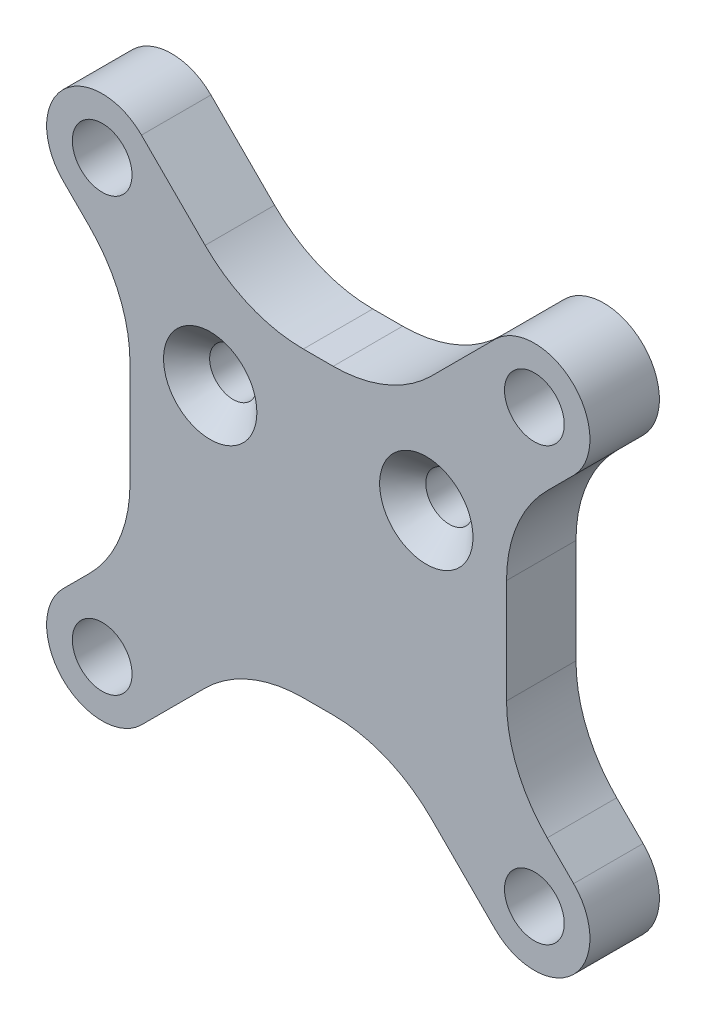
ISO-10303-21;
HEADER;
FILE_DESCRIPTION(('STEP AP214'),'2;1');
FILE_NAME('part.step','',(''),(''),'','','');
FILE_SCHEMA(('AUTOMOTIVE_DESIGN { 1 0 10303 214 1 1 1 1 }'));
ENDSEC;
DATA;
#1=APPLICATION_CONTEXT('core data for automotive mechanical design processes');
#2=APPLICATION_PROTOCOL_DEFINITION('international standard','automotive_design',2000,#1);
#3=PRODUCT_CONTEXT('',#1,'mechanical');
#4=PRODUCT('Part','Part','',(#3));
#5=PRODUCT_RELATED_PRODUCT_CATEGORY('part','',(#4));
#6=PRODUCT_DEFINITION_FORMATION('','',#4);
#7=PRODUCT_DEFINITION_CONTEXT('part definition',#1,'design');
#8=PRODUCT_DEFINITION('design','',#6,#7);
#9=PRODUCT_DEFINITION_SHAPE('','',#8);
#10=(LENGTH_UNIT() NAMED_UNIT(*) SI_UNIT(.MILLI.,.METRE.));
#11=(NAMED_UNIT(*) PLANE_ANGLE_UNIT() SI_UNIT($,.RADIAN.));
#12=(NAMED_UNIT(*) SI_UNIT($,.STERADIAN.) SOLID_ANGLE_UNIT());
#13=UNCERTAINTY_MEASURE_WITH_UNIT(LENGTH_MEASURE(1.E-05),#10,'distance_accuracy_value','');
#14=(GEOMETRIC_REPRESENTATION_CONTEXT(3) GLOBAL_UNCERTAINTY_ASSIGNED_CONTEXT((#13)) GLOBAL_UNIT_ASSIGNED_CONTEXT((#10,
#11,#12)) REPRESENTATION_CONTEXT('',''));
#15=CARTESIAN_POINT('',(0.,0.,0.));
#16=DIRECTION('',(0.,0.,1.));
#17=DIRECTION('',(1.,0.,0.));
#18=AXIS2_PLACEMENT_3D('',#15,#16,#17);
#19=CARTESIAN_POINT('',(0.,0.,1.));
#20=DIRECTION('',(0.,0.,1.));
#21=DIRECTION('',(1.,0.,0.));
#22=AXIS2_PLACEMENT_3D('',#19,#20,#21);
#23=PLANE('',#22);
#24=CARTESIAN_POINT('',(-7.77875,5.23875,1.));
#25=DIRECTION('',(0.,0.,1.));
#26=DIRECTION('',(1.,0.,0.));
#27=AXIS2_PLACEMENT_3D('',#24,#25,#26);
#28=CIRCLE('',#27,1.7);
#29=CARTESIAN_POINT('',(-6.07875,5.23875,1.));
#30=VERTEX_POINT('',#29);
#31=EDGE_CURVE('E590',#30,#30,#28,.T.);
#32=ORIENTED_EDGE('',*,*,#31,.T.);
#33=EDGE_LOOP('',(#32));
#34=FACE_BOUND('',#33,.T.);
#35=CARTESIAN_POINT('',(7.77875,5.23875,1.));
#36=DIRECTION('',(0.,0.,1.));
#37=DIRECTION('',(1.,0.,0.));
#38=AXIS2_PLACEMENT_3D('',#35,#36,#37);
#39=CIRCLE('',#38,1.7);
#40=CARTESIAN_POINT('',(9.47875,5.23875,1.));
#41=VERTEX_POINT('',#40);
#42=EDGE_CURVE('E584',#41,#41,#39,.T.);
#43=ORIENTED_EDGE('',*,*,#42,.T.);
#44=EDGE_LOOP('',(#43));
#45=FACE_BOUND('',#44,.T.);
#46=DIRECTION('',(1.,0.,0.));
#47=VECTOR('',#46,1.);
#48=CARTESIAN_POINT('',(0.,-5.31099999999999,1.));
#49=LINE('',#48,#47);
#50=CARTESIAN_POINT('',(-10.7037,-5.31099999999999,1.));
#51=VERTEX_POINT('',#50);
#52=CARTESIAN_POINT('',(10.7037,-5.31099999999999,1.));
#53=VERTEX_POINT('',#52);
#54=EDGE_CURVE('E330',#51,#53,#49,.T.);
#55=ORIENTED_EDGE('',*,*,#54,.F.);
#56=DIRECTION('',(0.,-1.,0.));
#57=VECTOR('',#56,1.);
#58=CARTESIAN_POINT('',(-10.7037,0.,1.));
#59=LINE('',#58,#57);
#60=CARTESIAN_POINT('',(-10.7037,6.23769318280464,1.));
#61=VERTEX_POINT('',#60);
#62=EDGE_CURVE('E431',#61,#51,#59,.T.);
#63=ORIENTED_EDGE('',*,*,#62,.F.);
#64=CARTESIAN_POINT('',(-11.7037,6.23769318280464,1.));
#65=DIRECTION('',(0.,0.,1.));
#66=DIRECTION('',(1.,0.,0.));
#67=AXIS2_PLACEMENT_3D('',#64,#65,#66);
#68=CIRCLE('',#67,1.);
#69=CARTESIAN_POINT('',(-11.1287,7.05584659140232,1.));
#70=VERTEX_POINT('',#69);
#71=EDGE_CURVE('E746',#61,#70,#68,.T.);
#72=ORIENTED_EDGE('',*,*,#71,.T.);
#73=CARTESIAN_POINT('',(-10.5537,7.874,1.));
#74=DIRECTION('',(0.,0.,1.));
#75=DIRECTION('',(1.,0.,0.));
#76=AXIS2_PLACEMENT_3D('',#73,#74,#75);
#77=CIRCLE('',#76,1.);
#78=CARTESIAN_POINT('',(-9.73554659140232,8.449,1.));
#79=VERTEX_POINT('',#78);
#80=EDGE_CURVE('E609',#79,#70,#77,.T.);
#81=ORIENTED_EDGE('',*,*,#80,.F.);
#82=CARTESIAN_POINT('',(-8.91739318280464,9.024,1.));
#83=DIRECTION('',(0.,0.,1.));
#84=DIRECTION('',(1.,0.,0.));
#85=AXIS2_PLACEMENT_3D('',#82,#83,#84);
#86=CIRCLE('',#85,1.);
#87=CARTESIAN_POINT('',(-8.91739318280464,8.024,1.));
#88=VERTEX_POINT('',#87);
#89=EDGE_CURVE('E57',#79,#88,#86,.T.);
#90=ORIENTED_EDGE('',*,*,#89,.T.);
#91=DIRECTION('',(-1.,0.,0.));
#92=VECTOR('',#91,1.);
#93=CARTESIAN_POINT('',(0.,8.024,1.));
#94=LINE('',#93,#92);
#95=CARTESIAN_POINT('',(8.91739318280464,8.024,1.));
#96=VERTEX_POINT('',#95);
#97=EDGE_CURVE('E638',#96,#88,#94,.T.);
#98=ORIENTED_EDGE('',*,*,#97,.F.);
#99=CARTESIAN_POINT('',(8.91739318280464,9.024,1.));
#100=DIRECTION('',(0.,0.,1.));
#101=DIRECTION('',(1.,0.,0.));
#102=AXIS2_PLACEMENT_3D('',#99,#100,#101);
#103=CIRCLE('',#102,1.);
#104=CARTESIAN_POINT('',(9.73554659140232,8.449,1.));
#105=VERTEX_POINT('',#104);
#106=EDGE_CURVE('E13',#96,#105,#103,.T.);
#107=ORIENTED_EDGE('',*,*,#106,.T.);
#108=CARTESIAN_POINT('',(10.5537,7.874,1.));
#109=DIRECTION('',(0.,0.,1.));
#110=DIRECTION('',(1.,0.,0.));
#111=AXIS2_PLACEMENT_3D('',#108,#109,#110);
#112=CIRCLE('',#111,1.);
#113=CARTESIAN_POINT('',(11.1286999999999,7.05584659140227,1.));
#114=VERTEX_POINT('',#113);
#115=EDGE_CURVE('E353',#114,#105,#112,.T.);
#116=ORIENTED_EDGE('',*,*,#115,.F.);
#117=CARTESIAN_POINT('',(11.7036999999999,6.23769318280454,1.));
#118=DIRECTION('',(0.,0.,1.));
#119=DIRECTION('',(1.,0.,0.));
#120=AXIS2_PLACEMENT_3D('',#117,#118,#119);
#121=CIRCLE('',#120,1.);
#122=CARTESIAN_POINT('',(10.7036999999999,6.23769318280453,1.));
#123=VERTEX_POINT('',#122);
#124=EDGE_CURVE('E743',#114,#123,#121,.T.);
#125=ORIENTED_EDGE('',*,*,#124,.T.);
#126=DIRECTION('',(0.,1.,0.));
#127=VECTOR('',#126,1.);
#128=CARTESIAN_POINT('',(10.7036999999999,1.10748668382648E-13,1.));
#129=LINE('',#128,#127);
#130=EDGE_CURVE('E633',#53,#123,#129,.T.);
#131=ORIENTED_EDGE('',*,*,#130,.F.);
#132=EDGE_LOOP('',(#55,#63,#72,#81,#90,#98,#107,#116,#125,#131));
#133=FACE_BOUND('',#132,.T.);
#134=ADVANCED_FACE('F48',(#34,#45,#133),#23,.F.);
#135=CARTESIAN_POINT('',(-1.07501012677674,-20.8740000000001,5.));
#136=DIRECTION('',(0.,0.,-1.));
#137=DIRECTION('',(-1.,0.,0.));
#138=AXIS2_PLACEMENT_3D('',#135,#136,#137);
#139=CYLINDRICAL_SURFACE('',#138,10.0000000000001);
#140=CARTESIAN_POINT('',(-1.07501012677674,-20.8740000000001,0.));
#141=DIRECTION('',(0.,0.,1.));
#142=DIRECTION('',(1.,0.,0.));
#143=AXIS2_PLACEMENT_3D('',#140,#141,#142);
#144=CIRCLE('',#143,10.0000000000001);
#145=CARTESIAN_POINT('',(-1.07501012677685,-10.8740000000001,0.));
#146=VERTEX_POINT('',#145);
#147=CARTESIAN_POINT('',(-8.14607793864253,-13.8029321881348,0.));
#148=VERTEX_POINT('',#147);
#149=EDGE_CURVE('E325',#146,#148,#144,.T.);
#150=ORIENTED_EDGE('',*,*,#149,.F.);
#151=DIRECTION('',(0.,0.,-1.));
#152=VECTOR('',#151,1.);
#153=CARTESIAN_POINT('',(-1.07501012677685,-10.8740000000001,5.));
#154=LINE('',#153,#152);
#155=CARTESIAN_POINT('',(-1.07501012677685,-10.8740000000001,5.));
#156=VERTEX_POINT('',#155);
#157=EDGE_CURVE('E318',#156,#146,#154,.T.);
#158=ORIENTED_EDGE('',*,*,#157,.F.);
#159=CARTESIAN_POINT('',(-1.07501012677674,-20.8740000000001,5.));
#160=DIRECTION('',(0.,0.,1.));
#161=DIRECTION('',(1.,0.,0.));
#162=AXIS2_PLACEMENT_3D('',#159,#160,#161);
#163=CIRCLE('',#162,10.0000000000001);
#164=CARTESIAN_POINT('',(-8.14607793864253,-13.8029321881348,5.));
#165=VERTEX_POINT('',#164);
#166=EDGE_CURVE('E322',#156,#165,#163,.T.);
#167=ORIENTED_EDGE('',*,*,#166,.T.);
#168=DIRECTION('',(0.,0.,-1.));
#169=VECTOR('',#168,1.);
#170=CARTESIAN_POINT('',(-8.14607793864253,-13.8029321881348,5.));
#171=LINE('',#170,#169);
#172=EDGE_CURVE('E427',#165,#148,#171,.T.);
#173=ORIENTED_EDGE('',*,*,#172,.T.);
#174=EDGE_LOOP('',(#150,#158,#167,#173));
#175=FACE_BOUND('',#174,.T.);
#176=ADVANCED_FACE('F320',(#175),#139,.F.);
#177=CARTESIAN_POINT('',(-5.52735785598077E-13,-10.8740000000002,5.));
#178=DIRECTION('',(0.,1.,0.));
#179=DIRECTION('',(-1.,0.,0.));
#180=AXIS2_PLACEMENT_3D('',#177,#178,#179);
#181=PLANE('',#180);
#182=DIRECTION('',(1.,0.,0.));
#183=VECTOR('',#182,1.);
#184=CARTESIAN_POINT('',(-5.52735785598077E-13,-10.8740000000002,0.));
#185=LINE('',#184,#183);
#186=CARTESIAN_POINT('',(1.07501012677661,-10.8740000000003,0.));
#187=VERTEX_POINT('',#186);
#188=EDGE_CURVE('E430',#146,#187,#185,.T.);
#189=ORIENTED_EDGE('',*,*,#188,.T.);
#190=DIRECTION('',(0.,0.,-1.));
#191=VECTOR('',#190,1.);
#192=CARTESIAN_POINT('',(1.07501012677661,-10.8740000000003,5.));
#193=LINE('',#192,#191);
#194=CARTESIAN_POINT('',(1.07501012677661,-10.8740000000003,5.));
#195=VERTEX_POINT('',#194);
#196=EDGE_CURVE('E331',#195,#187,#193,.T.);
#197=ORIENTED_EDGE('',*,*,#196,.F.);
#198=DIRECTION('',(1.,0.,0.));
#199=VECTOR('',#198,1.);
#200=CARTESIAN_POINT('',(-5.52735785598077E-13,-10.8740000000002,5.));
#201=LINE('',#200,#199);
#202=EDGE_CURVE('E334',#156,#195,#201,.T.);
#203=ORIENTED_EDGE('',*,*,#202,.F.);
#204=ORIENTED_EDGE('',*,*,#157,.T.);
#205=EDGE_LOOP('',(#189,#197,#203,#204));
#206=FACE_BOUND('',#205,.T.);
#207=ADVANCED_FACE('F335',(#206),#181,.F.);
#208=CARTESIAN_POINT('',(1.0750101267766,-20.8740000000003,5.));
#209=DIRECTION('',(0.,0.,-1.));
#210=DIRECTION('',(-1.,0.,0.));
#211=AXIS2_PLACEMENT_3D('',#208,#209,#210);
#212=CYLINDRICAL_SURFACE('',#211,9.99999999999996);
#213=CARTESIAN_POINT('',(1.0750101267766,-20.8740000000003,0.));
#214=DIRECTION('',(0.,0.,1.));
#215=DIRECTION('',(1.,0.,0.));
#216=AXIS2_PLACEMENT_3D('',#213,#214,#215);
#217=CIRCLE('',#216,9.99999999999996);
#218=CARTESIAN_POINT('',(8.14607793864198,-13.8029321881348,0.));
#219=VERTEX_POINT('',#218);
#220=EDGE_CURVE('E434',#219,#187,#217,.T.);
#221=ORIENTED_EDGE('',*,*,#220,.F.);
#222=DIRECTION('',(0.,0.,-1.));
#223=VECTOR('',#222,1.);
#224=CARTESIAN_POINT('',(8.14607793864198,-13.8029321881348,5.));
#225=LINE('',#224,#223);
#226=CARTESIAN_POINT('',(8.14607793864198,-13.8029321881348,5.));
#227=VERTEX_POINT('',#226);
#228=EDGE_CURVE('E579',#227,#219,#225,.T.);
#229=ORIENTED_EDGE('',*,*,#228,.F.);
#230=CARTESIAN_POINT('',(1.0750101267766,-20.8740000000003,5.));
#231=DIRECTION('',(0.,0.,1.));
#232=DIRECTION('',(1.,0.,0.));
#233=AXIS2_PLACEMENT_3D('',#230,#231,#232);
#234=CIRCLE('',#233,9.99999999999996);
#235=EDGE_CURVE('E340',#227,#195,#234,.T.);
#236=ORIENTED_EDGE('',*,*,#235,.T.);
#237=ORIENTED_EDGE('',*,*,#196,.T.);
#238=EDGE_LOOP('',(#221,#229,#236,#237));
#239=FACE_BOUND('',#238,.T.);
#240=ADVANCED_FACE('F992',(#239),#212,.F.);
#241=CARTESIAN_POINT('',(-2.82842712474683,-2.82842712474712,5.));
#242=DIRECTION('',(-0.707106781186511,-0.707106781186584,0.));
#243=DIRECTION('',(0.707106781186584,-0.707106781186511,0.));
#244=AXIS2_PLACEMENT_3D('',#241,#242,#243);
#245=PLANE('',#244);
#246=DIRECTION('',(-0.707106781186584,0.707106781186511,0.));
#247=VECTOR('',#246,1.);
#248=CARTESIAN_POINT('',(-2.82842712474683,-2.82842712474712,0.));
#249=LINE('',#248,#247);
#250=CARTESIAN_POINT('',(12.7279220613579,-18.3847763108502,0.));
#251=VERTEX_POINT('',#250);
#252=EDGE_CURVE('E438',#251,#219,#249,.T.);
#253=ORIENTED_EDGE('',*,*,#252,.F.);
#254=DIRECTION('',(0.,0.,-1.));
#255=VECTOR('',#254,1.);
#256=CARTESIAN_POINT('',(12.7279220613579,-18.3847763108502,5.));
#257=LINE('',#256,#255);
#258=CARTESIAN_POINT('',(12.7279220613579,-18.3847763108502,5.));
#259=VERTEX_POINT('',#258);
#260=EDGE_CURVE('E576',#259,#251,#257,.T.);
#261=ORIENTED_EDGE('',*,*,#260,.F.);
#262=DIRECTION('',(-0.707106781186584,0.707106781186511,0.));
#263=VECTOR('',#262,1.);
#264=CARTESIAN_POINT('',(-2.82842712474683,-2.82842712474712,5.));
#265=LINE('',#264,#263);
#266=EDGE_CURVE('E358',#259,#227,#265,.T.);
#267=ORIENTED_EDGE('',*,*,#266,.T.);
#268=ORIENTED_EDGE('',*,*,#228,.T.);
#269=EDGE_LOOP('',(#253,#261,#267,#268));
#270=FACE_BOUND('',#269,.T.);
#271=ADVANCED_FACE('F988',(#270),#245,.T.);
#272=CARTESIAN_POINT('',(15.5563491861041,-15.556349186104,5.));
#273=DIRECTION('',(0.,0.,-1.));
#274=DIRECTION('',(-1.,0.,0.));
#275=AXIS2_PLACEMENT_3D('',#272,#273,#274);
#276=CYLINDRICAL_SURFACE('',#275,4.);
#277=CARTESIAN_POINT('',(15.5563491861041,-15.556349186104,0.));
#278=DIRECTION('',(0.,0.,1.));
#279=DIRECTION('',(1.,0.,0.));
#280=AXIS2_PLACEMENT_3D('',#277,#278,#279);
#281=CIRCLE('',#280,4.);
#282=CARTESIAN_POINT('',(18.3847763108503,-12.7279220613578,0.));
#283=VERTEX_POINT('',#282);
#284=EDGE_CURVE('E442',#251,#283,#281,.T.);
#285=ORIENTED_EDGE('',*,*,#284,.T.);
#286=DIRECTION('',(0.,0.,-1.));
#287=VECTOR('',#286,1.);
#288=CARTESIAN_POINT('',(18.3847763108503,-12.7279220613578,5.));
#289=LINE('',#288,#287);
#290=CARTESIAN_POINT('',(18.3847763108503,-12.7279220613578,5.));
#291=VERTEX_POINT('',#290);
#292=EDGE_CURVE('E572',#291,#283,#289,.T.);
#293=ORIENTED_EDGE('',*,*,#292,.F.);
#294=CARTESIAN_POINT('',(15.5563491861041,-15.556349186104,5.));
#295=DIRECTION('',(0.,0.,1.));
#296=DIRECTION('',(1.,0.,0.));
#297=AXIS2_PLACEMENT_3D('',#294,#295,#296);
#298=CIRCLE('',#297,4.);
#299=EDGE_CURVE('E362',#259,#291,#298,.T.);
#300=ORIENTED_EDGE('',*,*,#299,.F.);
#301=ORIENTED_EDGE('',*,*,#260,.T.);
#302=EDGE_LOOP('',(#285,#293,#300,#301));
#303=FACE_BOUND('',#302,.T.);
#304=ADVANCED_FACE('F984',(#303),#276,.T.);
#305=CARTESIAN_POINT('',(2.82842712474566,2.82842712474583,5.));
#306=DIRECTION('',(-0.707106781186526,-0.707106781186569,0.));
#307=DIRECTION('',(0.707106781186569,-0.707106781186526,0.));
#308=AXIS2_PLACEMENT_3D('',#305,#306,#307);
#309=PLANE('',#308);
#310=DIRECTION('',(-0.707106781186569,0.707106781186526,0.));
#311=VECTOR('',#310,1.);
#312=CARTESIAN_POINT('',(2.82842712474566,2.82842712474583,0.));
#313=LINE('',#312,#311);
#314=CARTESIAN_POINT('',(16.4826321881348,-10.8257779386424,0.));
#315=VERTEX_POINT('',#314);
#316=EDGE_CURVE('E445',#283,#315,#313,.T.);
#317=ORIENTED_EDGE('',*,*,#316,.T.);
#318=DIRECTION('',(0.,0.,-1.));
#319=VECTOR('',#318,1.);
#320=CARTESIAN_POINT('',(16.4826321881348,-10.8257779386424,5.));
#321=LINE('',#320,#319);
#322=CARTESIAN_POINT('',(16.4826321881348,-10.8257779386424,5.));
#323=VERTEX_POINT('',#322);
#324=EDGE_CURVE('E569',#323,#315,#321,.T.);
#325=ORIENTED_EDGE('',*,*,#324,.F.);
#326=DIRECTION('',(-0.707106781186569,0.707106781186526,0.));
#327=VECTOR('',#326,1.);
#328=CARTESIAN_POINT('',(2.82842712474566,2.82842712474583,5.));
#329=LINE('',#328,#327);
#330=EDGE_CURVE('E365',#291,#323,#329,.T.);
#331=ORIENTED_EDGE('',*,*,#330,.F.);
#332=ORIENTED_EDGE('',*,*,#292,.T.);
#333=EDGE_LOOP('',(#317,#325,#331,#332));
#334=FACE_BOUND('',#333,.T.);
#335=ADVANCED_FACE('F980',(#334),#309,.F.);
#336=CARTESIAN_POINT('',(23.5537,-3.75471012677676,5.));
#337=DIRECTION('',(0.,0.,-1.));
#338=DIRECTION('',(-1.,0.,0.));
#339=AXIS2_PLACEMENT_3D('',#336,#337,#338);
#340=CYLINDRICAL_SURFACE('',#339,9.99999999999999);
#341=CARTESIAN_POINT('',(23.5537,-3.75471012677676,0.));
#342=DIRECTION('',(0.,0.,1.));
#343=DIRECTION('',(1.,0.,0.));
#344=AXIS2_PLACEMENT_3D('',#341,#342,#343);
#345=CIRCLE('',#344,9.99999999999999);
#346=CARTESIAN_POINT('',(13.5537,-3.75471012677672,0.));
#347=VERTEX_POINT('',#346);
#348=EDGE_CURVE('E449',#347,#315,#345,.T.);
#349=ORIENTED_EDGE('',*,*,#348,.F.);
#350=DIRECTION('',(0.,0.,-1.));
#351=VECTOR('',#350,1.);
#352=CARTESIAN_POINT('',(13.5537,-3.75471012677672,5.));
#353=LINE('',#352,#351);
#354=CARTESIAN_POINT('',(13.5537,-3.75471012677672,5.));
#355=VERTEX_POINT('',#354);
#356=EDGE_CURVE('E566',#355,#347,#353,.T.);
#357=ORIENTED_EDGE('',*,*,#356,.F.);
#358=CARTESIAN_POINT('',(23.5537,-3.75471012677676,5.));
#359=DIRECTION('',(0.,0.,1.));
#360=DIRECTION('',(1.,0.,0.));
#361=AXIS2_PLACEMENT_3D('',#358,#359,#360);
#362=CIRCLE('',#361,9.99999999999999);
#363=EDGE_CURVE('E368',#355,#323,#362,.T.);
#364=ORIENTED_EDGE('',*,*,#363,.T.);
#365=ORIENTED_EDGE('',*,*,#324,.T.);
#366=EDGE_LOOP('',(#349,#357,#364,#365));
#367=FACE_BOUND('',#366,.T.);
#368=ADVANCED_FACE('F976',(#367),#340,.F.);
#369=CARTESIAN_POINT('',(13.5537,0.,5.));
#370=DIRECTION('',(1.,0.,0.));
#371=DIRECTION('',(0.,1.,0.));
#372=AXIS2_PLACEMENT_3D('',#369,#370,#371);
#373=PLANE('',#372);
#374=DIRECTION('',(0.,-1.,0.));
#375=VECTOR('',#374,1.);
#376=CARTESIAN_POINT('',(13.5537,0.,0.));
#377=LINE('',#376,#375);
#378=CARTESIAN_POINT('',(13.5537,3.75471012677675,0.));
#379=VERTEX_POINT('',#378);
#380=EDGE_CURVE('E453',#379,#347,#377,.T.);
#381=ORIENTED_EDGE('',*,*,#380,.F.);
#382=DIRECTION('',(0.,0.,-1.));
#383=VECTOR('',#382,1.);
#384=CARTESIAN_POINT('',(13.5537,3.75471012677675,5.));
#385=LINE('',#384,#383);
#386=CARTESIAN_POINT('',(13.5537,3.75471012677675,5.));
#387=VERTEX_POINT('',#386);
#388=EDGE_CURVE('E563',#387,#379,#385,.T.);
#389=ORIENTED_EDGE('',*,*,#388,.F.);
#390=DIRECTION('',(0.,-1.,0.));
#391=VECTOR('',#390,1.);
#392=CARTESIAN_POINT('',(13.5537,0.,5.));
#393=LINE('',#392,#391);
#394=EDGE_CURVE('E372',#387,#355,#393,.T.);
#395=ORIENTED_EDGE('',*,*,#394,.T.);
#396=ORIENTED_EDGE('',*,*,#356,.T.);
#397=EDGE_LOOP('',(#381,#389,#395,#396));
#398=FACE_BOUND('',#397,.T.);
#399=ADVANCED_FACE('F972',(#398),#373,.T.);
#400=CARTESIAN_POINT('',(23.5537,3.75471012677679,5.));
#401=DIRECTION('',(0.,0.,-1.));
#402=DIRECTION('',(-1.,0.,0.));
#403=AXIS2_PLACEMENT_3D('',#400,#401,#402);
#404=CYLINDRICAL_SURFACE('',#403,9.99999999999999);
#405=CARTESIAN_POINT('',(23.5537,3.75471012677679,0.));
#406=DIRECTION('',(0.,0.,1.));
#407=DIRECTION('',(1.,0.,0.));
#408=AXIS2_PLACEMENT_3D('',#405,#406,#407);
#409=CIRCLE('',#408,9.99999999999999);
#410=CARTESIAN_POINT('',(16.4826321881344,10.8257779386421,0.));
#411=VERTEX_POINT('',#410);
#412=EDGE_CURVE('E457',#379,#411,#409,.F.);
#413=ORIENTED_EDGE('',*,*,#412,.T.);
#414=DIRECTION('',(0.,0.,-1.));
#415=VECTOR('',#414,1.);
#416=CARTESIAN_POINT('',(16.4826321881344,10.8257779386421,5.));
#417=LINE('',#416,#415);
#418=CARTESIAN_POINT('',(16.4826321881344,10.8257779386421,5.));
#419=VERTEX_POINT('',#418);
#420=EDGE_CURVE('E559',#419,#411,#417,.T.);
#421=ORIENTED_EDGE('',*,*,#420,.F.);
#422=CARTESIAN_POINT('',(23.5537,3.75471012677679,5.));
#423=DIRECTION('',(0.,0.,1.));
#424=DIRECTION('',(1.,0.,0.));
#425=AXIS2_PLACEMENT_3D('',#422,#423,#424);
#426=CIRCLE('',#425,9.99999999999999);
#427=EDGE_CURVE('E376',#387,#419,#426,.F.);
#428=ORIENTED_EDGE('',*,*,#427,.F.);
#429=ORIENTED_EDGE('',*,*,#388,.T.);
#430=EDGE_LOOP('',(#413,#421,#428,#429));
#431=FACE_BOUND('',#430,.T.);
#432=ADVANCED_FACE('F968',(#431),#404,.F.);
#433=CARTESIAN_POINT('',(2.82842712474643,-2.82842712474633,5.));
#434=DIRECTION('',(-0.70710678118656,0.707106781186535,0.));
#435=DIRECTION('',(-0.707106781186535,-0.70710678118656,0.));
#436=AXIS2_PLACEMENT_3D('',#433,#434,#435);
#437=PLANE('',#436);
#438=DIRECTION('',(0.707106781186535,0.70710678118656,0.));
#439=VECTOR('',#438,1.);
#440=CARTESIAN_POINT('',(2.82842712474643,-2.82842712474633,0.));
#441=LINE('',#440,#439);
#442=CARTESIAN_POINT('',(18.3847763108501,12.7279220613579,0.));
#443=VERTEX_POINT('',#442);
#444=EDGE_CURVE('E460',#411,#443,#441,.T.);
#445=ORIENTED_EDGE('',*,*,#444,.T.);
#446=DIRECTION('',(0.,0.,-1.));
#447=VECTOR('',#446,1.);
#448=CARTESIAN_POINT('',(18.3847763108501,12.7279220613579,5.));
#449=LINE('',#448,#447);
#450=CARTESIAN_POINT('',(18.3847763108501,12.7279220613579,5.));
#451=VERTEX_POINT('',#450);
#452=EDGE_CURVE('E555',#451,#443,#449,.T.);
#453=ORIENTED_EDGE('',*,*,#452,.F.);
#454=DIRECTION('',(0.707106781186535,0.70710678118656,0.));
#455=VECTOR('',#454,1.);
#456=CARTESIAN_POINT('',(2.82842712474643,-2.82842712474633,5.));
#457=LINE('',#456,#455);
#458=EDGE_CURVE('E379',#419,#451,#457,.T.);
#459=ORIENTED_EDGE('',*,*,#458,.F.);
#460=ORIENTED_EDGE('',*,*,#420,.T.);
#461=EDGE_LOOP('',(#445,#453,#459,#460));
#462=FACE_BOUND('',#461,.T.);
#463=ADVANCED_FACE('F964',(#462),#437,.F.);
#464=CARTESIAN_POINT('',(15.5563491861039,15.5563491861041,5.));
#465=DIRECTION('',(0.,0.,-1.));
#466=DIRECTION('',(-1.,0.,0.));
#467=AXIS2_PLACEMENT_3D('',#464,#465,#466);
#468=CYLINDRICAL_SURFACE('',#467,4.);
#469=CARTESIAN_POINT('',(15.5563491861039,15.5563491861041,0.));
#470=DIRECTION('',(0.,0.,1.));
#471=DIRECTION('',(1.,0.,0.));
#472=AXIS2_PLACEMENT_3D('',#469,#470,#471);
#473=CIRCLE('',#472,4.);
#474=CARTESIAN_POINT('',(12.7279220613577,18.3847763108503,0.));
#475=VERTEX_POINT('',#474);
#476=EDGE_CURVE('E463',#443,#475,#473,.T.);
#477=ORIENTED_EDGE('',*,*,#476,.T.);
#478=DIRECTION('',(0.,0.,-1.));
#479=VECTOR('',#478,1.);
#480=CARTESIAN_POINT('',(12.7279220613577,18.3847763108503,5.));
#481=LINE('',#480,#479);
#482=CARTESIAN_POINT('',(12.7279220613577,18.3847763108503,5.));
#483=VERTEX_POINT('',#482);
#484=EDGE_CURVE('E551',#483,#475,#481,.T.);
#485=ORIENTED_EDGE('',*,*,#484,.F.);
#486=CARTESIAN_POINT('',(15.5563491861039,15.5563491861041,5.));
#487=DIRECTION('',(0.,0.,1.));
#488=DIRECTION('',(1.,0.,0.));
#489=AXIS2_PLACEMENT_3D('',#486,#487,#488);
#490=CIRCLE('',#489,4.);
#491=EDGE_CURVE('E382',#451,#483,#490,.T.);
#492=ORIENTED_EDGE('',*,*,#491,.F.);
#493=ORIENTED_EDGE('',*,*,#452,.T.);
#494=EDGE_LOOP('',(#477,#485,#492,#493));
#495=FACE_BOUND('',#494,.T.);
#496=ADVANCED_FACE('F960',(#495),#468,.T.);
#497=CARTESIAN_POINT('',(-2.82842712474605,2.82842712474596,5.));
#498=DIRECTION('',(0.70710678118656,-0.707106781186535,0.));
#499=DIRECTION('',(0.707106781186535,0.70710678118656,0.));
#500=AXIS2_PLACEMENT_3D('',#497,#498,#499);
#501=PLANE('',#500);
#502=DIRECTION('',(-0.707106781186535,-0.70710678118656,0.));
#503=VECTOR('',#502,1.);
#504=CARTESIAN_POINT('',(-2.82842712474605,2.82842712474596,0.));
#505=LINE('',#504,#503);
#506=CARTESIAN_POINT('',(8.14607793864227,13.8029321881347,0.));
#507=VERTEX_POINT('',#506);
#508=EDGE_CURVE('E466',#475,#507,#505,.T.);
#509=ORIENTED_EDGE('',*,*,#508,.T.);
#510=DIRECTION('',(0.,0.,-1.));
#511=VECTOR('',#510,1.);
#512=CARTESIAN_POINT('',(8.14607793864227,13.8029321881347,5.));
#513=LINE('',#512,#511);
#514=CARTESIAN_POINT('',(8.14607793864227,13.8029321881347,5.));
#515=VERTEX_POINT('',#514);
#516=EDGE_CURVE('E547',#515,#507,#513,.T.);
#517=ORIENTED_EDGE('',*,*,#516,.F.);
#518=DIRECTION('',(-0.707106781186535,-0.70710678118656,0.));
#519=VECTOR('',#518,1.);
#520=CARTESIAN_POINT('',(-2.82842712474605,2.82842712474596,5.));
#521=LINE('',#520,#519);
#522=EDGE_CURVE('E385',#483,#515,#521,.T.);
#523=ORIENTED_EDGE('',*,*,#522,.F.);
#524=ORIENTED_EDGE('',*,*,#484,.T.);
#525=EDGE_LOOP('',(#509,#517,#523,#524));
#526=FACE_BOUND('',#525,.T.);
#527=ADVANCED_FACE('F956',(#526),#501,.F.);
#528=CARTESIAN_POINT('',(1.0750101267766,20.874,5.));
#529=DIRECTION('',(0.,0.,-1.));
#530=DIRECTION('',(-1.,0.,0.));
#531=AXIS2_PLACEMENT_3D('',#528,#529,#530);
#532=CYLINDRICAL_SURFACE('',#531,10.);
#533=CARTESIAN_POINT('',(1.0750101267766,20.874,0.));
#534=DIRECTION('',(0.,0.,1.));
#535=DIRECTION('',(1.,0.,0.));
#536=AXIS2_PLACEMENT_3D('',#533,#534,#535);
#537=CIRCLE('',#536,10.);
#538=CARTESIAN_POINT('',(1.07501012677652,10.874,0.));
#539=VERTEX_POINT('',#538);
#540=EDGE_CURVE('E469',#507,#539,#537,.F.);
#541=ORIENTED_EDGE('',*,*,#540,.T.);
#542=DIRECTION('',(0.,0.,-1.));
#543=VECTOR('',#542,1.);
#544=CARTESIAN_POINT('',(1.07501012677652,10.874,5.));
#545=LINE('',#544,#543);
#546=CARTESIAN_POINT('',(1.07501012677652,10.874,5.));
#547=VERTEX_POINT('',#546);
#548=EDGE_CURVE('E544',#547,#539,#545,.T.);
#549=ORIENTED_EDGE('',*,*,#548,.F.);
#550=CARTESIAN_POINT('',(1.0750101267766,20.874,5.));
#551=DIRECTION('',(0.,0.,1.));
#552=DIRECTION('',(1.,0.,0.));
#553=AXIS2_PLACEMENT_3D('',#550,#551,#552);
#554=CIRCLE('',#553,10.);
#555=EDGE_CURVE('E388',#515,#547,#554,.F.);
#556=ORIENTED_EDGE('',*,*,#555,.F.);
#557=ORIENTED_EDGE('',*,*,#516,.T.);
#558=EDGE_LOOP('',(#541,#549,#556,#557));
#559=FACE_BOUND('',#558,.T.);
#560=ADVANCED_FACE('F952',(#559),#532,.F.);
#561=CARTESIAN_POINT('',(0.,10.874,5.));
#562=DIRECTION('',(0.,1.,0.));
#563=DIRECTION('',(0.,0.,1.));
#564=AXIS2_PLACEMENT_3D('',#561,#562,#563);
#565=PLANE('',#564);
#566=DIRECTION('',(1.,0.,0.));
#567=VECTOR('',#566,1.);
#568=CARTESIAN_POINT('',(0.,10.874,0.));
#569=LINE('',#568,#567);
#570=CARTESIAN_POINT('',(-1.07501012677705,10.874,0.));
#571=VERTEX_POINT('',#570);
#572=EDGE_CURVE('E473',#571,#539,#569,.T.);
#573=ORIENTED_EDGE('',*,*,#572,.F.);
#574=DIRECTION('',(0.,0.,-1.));
#575=VECTOR('',#574,1.);
#576=CARTESIAN_POINT('',(-1.07501012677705,10.874,5.));
#577=LINE('',#576,#575);
#578=CARTESIAN_POINT('',(-1.07501012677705,10.874,5.));
#579=VERTEX_POINT('',#578);
#580=EDGE_CURVE('E541',#579,#571,#577,.T.);
#581=ORIENTED_EDGE('',*,*,#580,.F.);
#582=DIRECTION('',(1.,0.,0.));
#583=VECTOR('',#582,1.);
#584=CARTESIAN_POINT('',(0.,10.874,5.));
#585=LINE('',#584,#583);
#586=EDGE_CURVE('E391',#579,#547,#585,.T.);
#587=ORIENTED_EDGE('',*,*,#586,.T.);
#588=ORIENTED_EDGE('',*,*,#548,.T.);
#589=EDGE_LOOP('',(#573,#581,#587,#588));
#590=FACE_BOUND('',#589,.T.);
#591=ADVANCED_FACE('F948',(#590),#565,.T.);
#592=CARTESIAN_POINT('',(-1.07501012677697,20.874,5.));
#593=DIRECTION('',(0.,0.,-1.));
#594=DIRECTION('',(-1.,0.,0.));
#595=AXIS2_PLACEMENT_3D('',#592,#593,#594);
#596=CYLINDRICAL_SURFACE('',#595,9.99999999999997);
#597=CARTESIAN_POINT('',(-1.07501012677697,20.874,0.));
#598=DIRECTION('',(0.,0.,1.));
#599=DIRECTION('',(1.,0.,0.));
#600=AXIS2_PLACEMENT_3D('',#597,#598,#599);
#601=CIRCLE('',#600,9.99999999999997);
#602=CARTESIAN_POINT('',(-8.14607793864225,13.8029321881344,0.));
#603=VERTEX_POINT('',#602);
#604=EDGE_CURVE('E477',#571,#603,#601,.F.);
#605=ORIENTED_EDGE('',*,*,#604,.T.);
#606=DIRECTION('',(0.,0.,-1.));
#607=VECTOR('',#606,1.);
#608=CARTESIAN_POINT('',(-8.14607793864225,13.8029321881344,5.));
#609=LINE('',#608,#607);
#610=CARTESIAN_POINT('',(-8.14607793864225,13.8029321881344,5.));
#611=VERTEX_POINT('',#610);
#612=EDGE_CURVE('E537',#611,#603,#609,.T.);
#613=ORIENTED_EDGE('',*,*,#612,.F.);
#614=CARTESIAN_POINT('',(-1.07501012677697,20.874,5.));
#615=DIRECTION('',(0.,0.,1.));
#616=DIRECTION('',(1.,0.,0.));
#617=AXIS2_PLACEMENT_3D('',#614,#615,#616);
#618=CIRCLE('',#617,9.99999999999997);
#619=EDGE_CURVE('E395',#579,#611,#618,.F.);
#620=ORIENTED_EDGE('',*,*,#619,.F.);
#621=ORIENTED_EDGE('',*,*,#580,.T.);
#622=EDGE_LOOP('',(#605,#613,#620,#621));
#623=FACE_BOUND('',#622,.T.);
#624=ADVANCED_FACE('F944',(#623),#596,.F.);
#625=CARTESIAN_POINT('',(2.82842712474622,2.82842712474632,5.));
#626=DIRECTION('',(-0.707106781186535,-0.70710678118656,0.));
#627=DIRECTION('',(0.70710678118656,-0.707106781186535,0.));
#628=AXIS2_PLACEMENT_3D('',#625,#626,#627);
#629=PLANE('',#628);
#630=DIRECTION('',(-0.70710678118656,0.707106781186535,0.));
#631=VECTOR('',#630,1.);
#632=CARTESIAN_POINT('',(2.82842712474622,2.82842712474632,0.));
#633=LINE('',#632,#631);
#634=CARTESIAN_POINT('',(-12.727922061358,18.38477631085,0.));
#635=VERTEX_POINT('',#634);
#636=EDGE_CURVE('E480',#603,#635,#633,.T.);
#637=ORIENTED_EDGE('',*,*,#636,.T.);
#638=DIRECTION('',(0.,0.,-1.));
#639=VECTOR('',#638,1.);
#640=CARTESIAN_POINT('',(-12.727922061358,18.38477631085,5.));
#641=LINE('',#640,#639);
#642=CARTESIAN_POINT('',(-12.727922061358,18.38477631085,5.));
#643=VERTEX_POINT('',#642);
#644=EDGE_CURVE('E533',#643,#635,#641,.T.);
#645=ORIENTED_EDGE('',*,*,#644,.F.);
#646=DIRECTION('',(-0.70710678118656,0.707106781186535,0.));
#647=VECTOR('',#646,1.);
#648=CARTESIAN_POINT('',(2.82842712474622,2.82842712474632,5.));
#649=LINE('',#648,#647);
#650=EDGE_CURVE('E398',#611,#643,#649,.T.);
#651=ORIENTED_EDGE('',*,*,#650,.F.);
#652=ORIENTED_EDGE('',*,*,#612,.T.);
#653=EDGE_LOOP('',(#637,#645,#651,#652));
#654=FACE_BOUND('',#653,.T.);
#655=ADVANCED_FACE('F940',(#654),#629,.F.);
#656=CARTESIAN_POINT('',(-15.5563491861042,15.5563491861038,5.));
#657=DIRECTION('',(0.,0.,-1.));
#658=DIRECTION('',(-1.,0.,0.));
#659=AXIS2_PLACEMENT_3D('',#656,#657,#658);
#660=CYLINDRICAL_SURFACE('',#659,4.);
#661=CARTESIAN_POINT('',(-15.5563491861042,15.5563491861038,0.));
#662=DIRECTION('',(0.,0.,1.));
#663=DIRECTION('',(1.,0.,0.));
#664=AXIS2_PLACEMENT_3D('',#661,#662,#663);
#665=CIRCLE('',#664,4.);
#666=CARTESIAN_POINT('',(-18.3847763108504,12.7279220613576,0.));
#667=VERTEX_POINT('',#666);
#668=EDGE_CURVE('E483',#635,#667,#665,.T.);
#669=ORIENTED_EDGE('',*,*,#668,.T.);
#670=DIRECTION('',(0.,0.,-1.));
#671=VECTOR('',#670,1.);
#672=CARTESIAN_POINT('',(-18.3847763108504,12.7279220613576,5.));
#673=LINE('',#672,#671);
#674=CARTESIAN_POINT('',(-18.3847763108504,12.7279220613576,5.));
#675=VERTEX_POINT('',#674);
#676=EDGE_CURVE('E530',#675,#667,#673,.T.);
#677=ORIENTED_EDGE('',*,*,#676,.F.);
#678=CARTESIAN_POINT('',(-15.5563491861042,15.5563491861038,5.));
#679=DIRECTION('',(0.,0.,1.));
#680=DIRECTION('',(1.,0.,0.));
#681=AXIS2_PLACEMENT_3D('',#678,#679,#680);
#682=CIRCLE('',#681,4.);
#683=EDGE_CURVE('E401',#643,#675,#682,.T.);
#684=ORIENTED_EDGE('',*,*,#683,.F.);
#685=ORIENTED_EDGE('',*,*,#644,.T.);
#686=EDGE_LOOP('',(#669,#677,#684,#685));
#687=FACE_BOUND('',#686,.T.);
#688=ADVANCED_FACE('F936',(#687),#660,.T.);
#689=CARTESIAN_POINT('',(-2.8284271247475,-2.82842712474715,5.));
#690=DIRECTION('',(-0.707106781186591,-0.707106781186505,0.));
#691=DIRECTION('',(0.707106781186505,-0.707106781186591,0.));
#692=AXIS2_PLACEMENT_3D('',#689,#690,#691);
#693=PLANE('',#692);
#694=DIRECTION('',(-0.707106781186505,0.707106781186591,0.));
#695=VECTOR('',#694,1.);
#696=CARTESIAN_POINT('',(-2.8284271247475,-2.82842712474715,0.));
#697=LINE('',#696,#695);
#698=CARTESIAN_POINT('',(-16.4826321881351,10.8257779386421,0.));
#699=VERTEX_POINT('',#698);
#700=EDGE_CURVE('E487',#699,#667,#697,.T.);
#701=ORIENTED_EDGE('',*,*,#700,.F.);
#702=DIRECTION('',(0.,0.,-1.));
#703=VECTOR('',#702,1.);
#704=CARTESIAN_POINT('',(-16.4826321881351,10.8257779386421,5.));
#705=LINE('',#704,#703);
#706=CARTESIAN_POINT('',(-16.4826321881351,10.8257779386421,5.));
#707=VERTEX_POINT('',#706);
#708=EDGE_CURVE('E527',#707,#699,#705,.T.);
#709=ORIENTED_EDGE('',*,*,#708,.F.);
#710=DIRECTION('',(-0.707106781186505,0.707106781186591,0.));
#711=VECTOR('',#710,1.);
#712=CARTESIAN_POINT('',(-2.8284271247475,-2.82842712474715,5.));
#713=LINE('',#712,#711);
#714=EDGE_CURVE('E404',#707,#675,#713,.T.);
#715=ORIENTED_EDGE('',*,*,#714,.T.);
#716=ORIENTED_EDGE('',*,*,#676,.T.);
#717=EDGE_LOOP('',(#701,#709,#715,#716));
#718=FACE_BOUND('',#717,.T.);
#719=ADVANCED_FACE('F932',(#718),#693,.T.);
#720=CARTESIAN_POINT('',(-23.5537000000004,3.75471012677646,5.));
#721=DIRECTION('',(0.,0.,-1.));
#722=DIRECTION('',(-1.,0.,0.));
#723=AXIS2_PLACEMENT_3D('',#720,#721,#722);
#724=CYLINDRICAL_SURFACE('',#723,10.);
#725=CARTESIAN_POINT('',(-23.5537000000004,3.75471012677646,0.));
#726=DIRECTION('',(0.,0.,1.));
#727=DIRECTION('',(1.,0.,0.));
#728=AXIS2_PLACEMENT_3D('',#725,#726,#727);
#729=CIRCLE('',#728,10.);
#730=CARTESIAN_POINT('',(-13.5537000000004,3.75471012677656,0.));
#731=VERTEX_POINT('',#730);
#732=EDGE_CURVE('E491',#731,#699,#729,.T.);
#733=ORIENTED_EDGE('',*,*,#732,.F.);
#734=DIRECTION('',(0.,0.,-1.));
#735=VECTOR('',#734,1.);
#736=CARTESIAN_POINT('',(-13.5537000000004,3.75471012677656,5.));
#737=LINE('',#736,#735);
#738=CARTESIAN_POINT('',(-13.5537000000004,3.75471012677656,5.));
#739=VERTEX_POINT('',#738);
#740=EDGE_CURVE('E524',#739,#731,#737,.T.);
#741=ORIENTED_EDGE('',*,*,#740,.F.);
#742=CARTESIAN_POINT('',(-23.5537000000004,3.75471012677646,5.));
#743=DIRECTION('',(0.,0.,1.));
#744=DIRECTION('',(1.,0.,0.));
#745=AXIS2_PLACEMENT_3D('',#742,#743,#744);
#746=CIRCLE('',#745,10.);
#747=EDGE_CURVE('E408',#739,#707,#746,.T.);
#748=ORIENTED_EDGE('',*,*,#747,.T.);
#749=ORIENTED_EDGE('',*,*,#708,.T.);
#750=EDGE_LOOP('',(#733,#741,#748,#749));
#751=FACE_BOUND('',#750,.T.);
#752=ADVANCED_FACE('F928',(#751),#724,.F.);
#753=CARTESIAN_POINT('',(-13.5537000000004,-1.90990405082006E-13,5.));
#754=DIRECTION('',(1.,0.,0.));
#755=DIRECTION('',(0.,1.,0.));
#756=AXIS2_PLACEMENT_3D('',#753,#754,#755);
#757=PLANE('',#756);
#758=DIRECTION('',(0.,-1.,0.));
#759=VECTOR('',#758,1.);
#760=CARTESIAN_POINT('',(-13.5537000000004,-1.90990405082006E-13,0.));
#761=LINE('',#760,#759);
#762=CARTESIAN_POINT('',(-13.5537000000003,-3.7547101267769,0.));
#763=VERTEX_POINT('',#762);
#764=EDGE_CURVE('E495',#731,#763,#761,.T.);
#765=ORIENTED_EDGE('',*,*,#764,.T.);
#766=DIRECTION('',(0.,0.,-1.));
#767=VECTOR('',#766,1.);
#768=CARTESIAN_POINT('',(-13.5537000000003,-3.7547101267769,5.));
#769=LINE('',#768,#767);
#770=CARTESIAN_POINT('',(-13.5537000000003,-3.7547101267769,5.));
#771=VERTEX_POINT('',#770);
#772=EDGE_CURVE('E520',#771,#763,#769,.T.);
#773=ORIENTED_EDGE('',*,*,#772,.F.);
#774=DIRECTION('',(0.,-1.,0.));
#775=VECTOR('',#774,1.);
#776=CARTESIAN_POINT('',(-13.5537000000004,-1.90990405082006E-13,5.));
#777=LINE('',#776,#775);
#778=EDGE_CURVE('E412',#739,#771,#777,.T.);
#779=ORIENTED_EDGE('',*,*,#778,.F.);
#780=ORIENTED_EDGE('',*,*,#740,.T.);
#781=EDGE_LOOP('',(#765,#773,#779,#780));
#782=FACE_BOUND('',#781,.T.);
#783=ADVANCED_FACE('F924',(#782),#757,.F.);
#784=CARTESIAN_POINT('',(-23.5537000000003,-3.75471012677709,5.));
#785=DIRECTION('',(0.,0.,-1.));
#786=DIRECTION('',(-1.,0.,0.));
#787=AXIS2_PLACEMENT_3D('',#784,#785,#786);
#788=CYLINDRICAL_SURFACE('',#787,9.99999999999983);
#789=CARTESIAN_POINT('',(-23.5537000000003,-3.75471012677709,0.));
#790=DIRECTION('',(0.,0.,1.));
#791=DIRECTION('',(1.,0.,0.));
#792=AXIS2_PLACEMENT_3D('',#789,#790,#791);
#793=CIRCLE('',#792,9.99999999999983);
#794=CARTESIAN_POINT('',(-16.4826321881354,-10.8257779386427,0.));
#795=VERTEX_POINT('',#794);
#796=EDGE_CURVE('E498',#763,#795,#793,.F.);
#797=ORIENTED_EDGE('',*,*,#796,.T.);
#798=DIRECTION('',(0.,0.,-1.));
#799=VECTOR('',#798,1.);
#800=CARTESIAN_POINT('',(-16.4826321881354,-10.8257779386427,5.));
#801=LINE('',#800,#799);
#802=CARTESIAN_POINT('',(-16.4826321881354,-10.8257779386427,5.));
#803=VERTEX_POINT('',#802);
#804=EDGE_CURVE('E517',#803,#795,#801,.T.);
#805=ORIENTED_EDGE('',*,*,#804,.F.);
#806=CARTESIAN_POINT('',(-23.5537000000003,-3.75471012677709,5.));
#807=DIRECTION('',(0.,0.,1.));
#808=DIRECTION('',(1.,0.,0.));
#809=AXIS2_PLACEMENT_3D('',#806,#807,#808);
#810=CIRCLE('',#809,9.99999999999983);
#811=EDGE_CURVE('E415',#771,#803,#810,.F.);
#812=ORIENTED_EDGE('',*,*,#811,.F.);
#813=ORIENTED_EDGE('',*,*,#772,.T.);
#814=EDGE_LOOP('',(#797,#805,#812,#813));
#815=FACE_BOUND('',#814,.T.);
#816=ADVANCED_FACE('F920',(#815),#788,.F.);
#817=CARTESIAN_POINT('',(-2.82842712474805,2.82842712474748,5.));
#818=DIRECTION('',(-0.707106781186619,0.707106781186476,0.));
#819=DIRECTION('',(-0.707106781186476,-0.707106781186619,0.));
#820=AXIS2_PLACEMENT_3D('',#817,#818,#819);
#821=PLANE('',#820);
#822=DIRECTION('',(0.707106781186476,0.707106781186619,0.));
#823=VECTOR('',#822,1.);
#824=CARTESIAN_POINT('',(-2.82842712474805,2.82842712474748,0.));
#825=LINE('',#824,#823);
#826=CARTESIAN_POINT('',(-18.3847763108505,-12.7279220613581,0.));
#827=VERTEX_POINT('',#826);
#828=EDGE_CURVE('E502',#827,#795,#825,.T.);
#829=ORIENTED_EDGE('',*,*,#828,.F.);
#830=DIRECTION('',(0.,0.,-1.));
#831=VECTOR('',#830,1.);
#832=CARTESIAN_POINT('',(-18.3847763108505,-12.7279220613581,5.));
#833=LINE('',#832,#831);
#834=CARTESIAN_POINT('',(-18.3847763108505,-12.7279220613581,5.));
#835=VERTEX_POINT('',#834);
#836=EDGE_CURVE('E514',#835,#827,#833,.T.);
#837=ORIENTED_EDGE('',*,*,#836,.F.);
#838=DIRECTION('',(0.707106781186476,0.707106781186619,0.));
#839=VECTOR('',#838,1.);
#840=CARTESIAN_POINT('',(-2.82842712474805,2.82842712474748,5.));
#841=LINE('',#840,#839);
#842=EDGE_CURVE('E418',#835,#803,#841,.T.);
#843=ORIENTED_EDGE('',*,*,#842,.T.);
#844=ORIENTED_EDGE('',*,*,#804,.T.);
#845=EDGE_LOOP('',(#829,#837,#843,#844));
#846=FACE_BOUND('',#845,.T.);
#847=ADVANCED_FACE('F916',(#846),#821,.T.);
#848=CARTESIAN_POINT('',(-15.556349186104,-15.5563491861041,5.));
#849=DIRECTION('',(0.,0.,-1.));
#850=DIRECTION('',(-1.,0.,0.));
#851=AXIS2_PLACEMENT_3D('',#848,#849,#850);
#852=CYLINDRICAL_SURFACE('',#851,4.00000000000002);
#853=CARTESIAN_POINT('',(-15.556349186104,-15.5563491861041,0.));
#854=DIRECTION('',(0.,0.,1.));
#855=DIRECTION('',(1.,0.,0.));
#856=AXIS2_PLACEMENT_3D('',#853,#854,#855);
#857=CIRCLE('',#856,4.00000000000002);
#858=CARTESIAN_POINT('',(-12.7279220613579,-18.3847763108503,0.));
#859=VERTEX_POINT('',#858);
#860=EDGE_CURVE('E350',#827,#859,#857,.T.);
#861=ORIENTED_EDGE('',*,*,#860,.T.);
#862=DIRECTION('',(0.,0.,-1.));
#863=VECTOR('',#862,1.);
#864=CARTESIAN_POINT('',(-12.7279220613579,-18.3847763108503,5.));
#865=LINE('',#864,#863);
#866=CARTESIAN_POINT('',(-12.7279220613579,-18.3847763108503,5.));
#867=VERTEX_POINT('',#866);
#868=EDGE_CURVE('E511',#867,#859,#865,.T.);
#869=ORIENTED_EDGE('',*,*,#868,.F.);
#870=CARTESIAN_POINT('',(-15.556349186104,-15.5563491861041,5.));
#871=DIRECTION('',(0.,0.,1.));
#872=DIRECTION('',(1.,0.,0.));
#873=AXIS2_PLACEMENT_3D('',#870,#871,#872);
#874=CIRCLE('',#873,4.00000000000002);
#875=EDGE_CURVE('E422',#835,#867,#874,.T.);
#876=ORIENTED_EDGE('',*,*,#875,.F.);
#877=ORIENTED_EDGE('',*,*,#836,.T.);
#878=EDGE_LOOP('',(#861,#869,#876,#877));
#879=FACE_BOUND('',#878,.T.);
#880=ADVANCED_FACE('F912',(#879),#852,.T.);
#881=CARTESIAN_POINT('',(2.82842712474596,-2.82842712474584,5.));
#882=DIRECTION('',(0.707106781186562,-0.707106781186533,0.));
#883=DIRECTION('',(0.707106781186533,0.707106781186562,0.));
#884=AXIS2_PLACEMENT_3D('',#881,#882,#883);
#885=PLANE('',#884);
#886=DIRECTION('',(-0.707106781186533,-0.707106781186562,0.));
#887=VECTOR('',#886,1.);
#888=CARTESIAN_POINT('',(2.82842712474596,-2.82842712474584,0.));
#889=LINE('',#888,#887);
#890=EDGE_CURVE('E346',#148,#859,#889,.T.);
#891=ORIENTED_EDGE('',*,*,#890,.F.);
#892=ORIENTED_EDGE('',*,*,#172,.F.);
#893=DIRECTION('',(-0.707106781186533,-0.707106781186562,0.));
#894=VECTOR('',#893,1.);
#895=CARTESIAN_POINT('',(2.82842712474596,-2.82842712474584,5.));
#896=LINE('',#895,#894);
#897=EDGE_CURVE('E344',#165,#867,#896,.T.);
#898=ORIENTED_EDGE('',*,*,#897,.T.);
#899=ORIENTED_EDGE('',*,*,#868,.T.);
#900=EDGE_LOOP('',(#891,#892,#898,#899));
#901=FACE_BOUND('',#900,.T.);
#902=ADVANCED_FACE('F907',(#901),#885,.T.);
#903=CARTESIAN_POINT('',(0.,0.,5.));
#904=DIRECTION('',(0.,0.,1.));
#905=DIRECTION('',(1.,0.,0.));
#906=AXIS2_PLACEMENT_3D('',#903,#904,#905);
#907=PLANE('',#906);
#908=CARTESIAN_POINT('',(15.5563491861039,15.5563491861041,5.));
#909=DIRECTION('',(0.,0.,-1.));
#910=DIRECTION('',(-1.,0.,0.));
#911=AXIS2_PLACEMENT_3D('',#908,#909,#910);
#912=CIRCLE('',#911,2.15);
#913=CARTESIAN_POINT('',(13.4063491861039,15.5563491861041,5.));
#914=VERTEX_POINT('',#913);
#915=EDGE_CURVE('E858',#914,#914,#912,.T.);
#916=ORIENTED_EDGE('',*,*,#915,.T.);
#917=EDGE_LOOP('',(#916));
#918=FACE_BOUND('',#917,.T.);
#919=CARTESIAN_POINT('',(15.5563491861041,-15.556349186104,5.));
#920=DIRECTION('',(0.,0.,-1.));
#921=DIRECTION('',(-1.,0.,0.));
#922=AXIS2_PLACEMENT_3D('',#919,#920,#921);
#923=CIRCLE('',#922,2.15);
#924=CARTESIAN_POINT('',(13.4063491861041,-15.556349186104,5.));
#925=VERTEX_POINT('',#924);
#926=EDGE_CURVE('E850',#925,#925,#923,.T.);
#927=ORIENTED_EDGE('',*,*,#926,.T.);
#928=EDGE_LOOP('',(#927));
#929=FACE_BOUND('',#928,.T.);
#930=CARTESIAN_POINT('',(-15.556349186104,-15.5563491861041,5.));
#931=DIRECTION('',(0.,0.,-1.));
#932=DIRECTION('',(-1.,0.,0.));
#933=AXIS2_PLACEMENT_3D('',#930,#931,#932);
#934=CIRCLE('',#933,2.15);
#935=CARTESIAN_POINT('',(-17.706349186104,-15.5563491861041,5.));
#936=VERTEX_POINT('',#935);
#937=EDGE_CURVE('E842',#936,#936,#934,.T.);
#938=ORIENTED_EDGE('',*,*,#937,.T.);
#939=EDGE_LOOP('',(#938));
#940=FACE_BOUND('',#939,.T.);
#941=CARTESIAN_POINT('',(-15.5563491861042,15.5563491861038,5.));
#942=DIRECTION('',(0.,0.,-1.));
#943=DIRECTION('',(-1.,0.,0.));
#944=AXIS2_PLACEMENT_3D('',#941,#942,#943);
#945=CIRCLE('',#944,2.15);
#946=CARTESIAN_POINT('',(-17.7063491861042,15.5563491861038,5.));
#947=VERTEX_POINT('',#946);
#948=EDGE_CURVE('E834',#947,#947,#945,.T.);
#949=ORIENTED_EDGE('',*,*,#948,.T.);
#950=EDGE_LOOP('',(#949));
#951=FACE_BOUND('',#950,.T.);
#952=CARTESIAN_POINT('',(-7.77875,5.23875,5.));
#953=DIRECTION('',(0.,0.,1.));
#954=DIRECTION('',(1.,0.,0.));
#955=AXIS2_PLACEMENT_3D('',#952,#953,#954);
#956=CIRCLE('',#955,3.36);
#957=CARTESIAN_POINT('',(-4.41875,5.23875,5.));
#958=VERTEX_POINT('',#957);
#959=EDGE_CURVE('E830',#958,#958,#956,.T.);
#960=ORIENTED_EDGE('',*,*,#959,.F.);
#961=EDGE_LOOP('',(#960));
#962=FACE_BOUND('',#961,.T.);
#963=CARTESIAN_POINT('',(7.77875,5.23875,5.));
#964=DIRECTION('',(0.,0.,1.));
#965=DIRECTION('',(1.,0.,0.));
#966=AXIS2_PLACEMENT_3D('',#963,#964,#965);
#967=CIRCLE('',#966,3.36);
#968=CARTESIAN_POINT('',(11.13875,5.23875,5.));
#969=VERTEX_POINT('',#968);
#970=EDGE_CURVE('E594',#969,#969,#967,.T.);
#971=ORIENTED_EDGE('',*,*,#970,.F.);
#972=EDGE_LOOP('',(#971));
#973=FACE_BOUND('',#972,.T.);
#974=ORIENTED_EDGE('',*,*,#166,.F.);
#975=ORIENTED_EDGE('',*,*,#202,.T.);
#976=ORIENTED_EDGE('',*,*,#235,.F.);
#977=ORIENTED_EDGE('',*,*,#266,.F.);
#978=ORIENTED_EDGE('',*,*,#299,.T.);
#979=ORIENTED_EDGE('',*,*,#330,.T.);
#980=ORIENTED_EDGE('',*,*,#363,.F.);
#981=ORIENTED_EDGE('',*,*,#394,.F.);
#982=ORIENTED_EDGE('',*,*,#427,.T.);
#983=ORIENTED_EDGE('',*,*,#458,.T.);
#984=ORIENTED_EDGE('',*,*,#491,.T.);
#985=ORIENTED_EDGE('',*,*,#522,.T.);
#986=ORIENTED_EDGE('',*,*,#555,.T.);
#987=ORIENTED_EDGE('',*,*,#586,.F.);
#988=ORIENTED_EDGE('',*,*,#619,.T.);
#989=ORIENTED_EDGE('',*,*,#650,.T.);
#990=ORIENTED_EDGE('',*,*,#683,.T.);
#991=ORIENTED_EDGE('',*,*,#714,.F.);
#992=ORIENTED_EDGE('',*,*,#747,.F.);
#993=ORIENTED_EDGE('',*,*,#778,.T.);
#994=ORIENTED_EDGE('',*,*,#811,.T.);
#995=ORIENTED_EDGE('',*,*,#842,.F.);
#996=ORIENTED_EDGE('',*,*,#875,.T.);
#997=ORIENTED_EDGE('',*,*,#897,.F.);
#998=EDGE_LOOP('',(#974,#975,#976,#977,#978,#979,#980,#981,#982,#983,#984,#985,#986,#987,#988,
#989,#990,#991,#992,#993,#994,#995,#996,#997));
#999=FACE_BOUND('',#998,.T.);
#1000=ADVANCED_FACE('F342',(#918,#929,#940,#951,#962,#973,#999),#907,.T.);
#1001=CARTESIAN_POINT('',(0.,0.,0.));
#1002=DIRECTION('',(0.,0.,1.));
#1003=DIRECTION('',(1.,0.,0.));
#1004=AXIS2_PLACEMENT_3D('',#1001,#1002,#1003);
#1005=PLANE('',#1004);
#1006=CARTESIAN_POINT('',(15.5563491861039,15.5563491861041,0.));
#1007=DIRECTION('',(0.,0.,-1.));
#1008=DIRECTION('',(-1.,0.,0.));
#1009=AXIS2_PLACEMENT_3D('',#1006,#1007,#1008);
#1010=CIRCLE('',#1009,2.15);
#1011=CARTESIAN_POINT('',(13.4063491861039,15.5563491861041,0.));
#1012=VERTEX_POINT('',#1011);
#1013=EDGE_CURVE('E862',#1012,#1012,#1010,.T.);
#1014=ORIENTED_EDGE('',*,*,#1013,.F.);
#1015=EDGE_LOOP('',(#1014));
#1016=FACE_BOUND('',#1015,.T.);
#1017=CARTESIAN_POINT('',(15.5563491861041,-15.556349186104,0.));
#1018=DIRECTION('',(0.,0.,-1.));
#1019=DIRECTION('',(-1.,0.,0.));
#1020=AXIS2_PLACEMENT_3D('',#1017,#1018,#1019);
#1021=CIRCLE('',#1020,2.15);
#1022=CARTESIAN_POINT('',(13.4063491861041,-15.556349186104,0.));
#1023=VERTEX_POINT('',#1022);
#1024=EDGE_CURVE('E854',#1023,#1023,#1021,.T.);
#1025=ORIENTED_EDGE('',*,*,#1024,.F.);
#1026=EDGE_LOOP('',(#1025));
#1027=FACE_BOUND('',#1026,.T.);
#1028=CARTESIAN_POINT('',(-15.556349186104,-15.5563491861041,0.));
#1029=DIRECTION('',(0.,0.,-1.));
#1030=DIRECTION('',(-1.,0.,0.));
#1031=AXIS2_PLACEMENT_3D('',#1028,#1029,#1030);
#1032=CIRCLE('',#1031,2.15);
#1033=CARTESIAN_POINT('',(-17.706349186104,-15.5563491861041,0.));
#1034=VERTEX_POINT('',#1033);
#1035=EDGE_CURVE('E846',#1034,#1034,#1032,.T.);
#1036=ORIENTED_EDGE('',*,*,#1035,.F.);
#1037=EDGE_LOOP('',(#1036));
#1038=FACE_BOUND('',#1037,.T.);
#1039=CARTESIAN_POINT('',(-15.5563491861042,15.5563491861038,0.));
#1040=DIRECTION('',(0.,0.,-1.));
#1041=DIRECTION('',(-1.,0.,0.));
#1042=AXIS2_PLACEMENT_3D('',#1039,#1040,#1041);
#1043=CIRCLE('',#1042,2.15);
#1044=CARTESIAN_POINT('',(-17.7063491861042,15.5563491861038,0.));
#1045=VERTEX_POINT('',#1044);
#1046=EDGE_CURVE('E838',#1045,#1045,#1043,.T.);
#1047=ORIENTED_EDGE('',*,*,#1046,.F.);
#1048=EDGE_LOOP('',(#1047));
#1049=FACE_BOUND('',#1048,.T.);
#1050=DIRECTION('',(0.,-1.,0.));
#1051=VECTOR('',#1050,1.);
#1052=CARTESIAN_POINT('',(-10.7037,0.,0.));
#1053=LINE('',#1052,#1051);
#1054=CARTESIAN_POINT('',(-10.7037,6.23769318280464,0.));
#1055=VERTEX_POINT('',#1054);
#1056=CARTESIAN_POINT('',(-10.7037,-6.23769318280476,0.));
#1057=VERTEX_POINT('',#1056);
#1058=EDGE_CURVE('E610',#1055,#1057,#1053,.T.);
#1059=ORIENTED_EDGE('',*,*,#1058,.T.);
#1060=CARTESIAN_POINT('',(-11.7037,-6.23769318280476,0.));
#1061=DIRECTION('',(0.,0.,1.));
#1062=DIRECTION('',(1.,0.,0.));
#1063=AXIS2_PLACEMENT_3D('',#1060,#1061,#1062);
#1064=CIRCLE('',#1063,1.);
#1065=CARTESIAN_POINT('',(-11.1286999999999,-7.05584659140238,0.));
#1066=VERTEX_POINT('',#1065);
#1067=EDGE_CURVE('E680',#1057,#1066,#1064,.F.);
#1068=ORIENTED_EDGE('',*,*,#1067,.T.);
#1069=CARTESIAN_POINT('',(-10.5536999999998,-7.874,0.));
#1070=DIRECTION('',(0.,0.,1.));
#1071=DIRECTION('',(1.,0.,0.));
#1072=AXIS2_PLACEMENT_3D('',#1069,#1070,#1071);
#1073=CIRCLE('',#1072,1.);
#1074=CARTESIAN_POINT('',(-9.73554659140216,-8.44900000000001,0.));
#1075=VERTEX_POINT('',#1074);
#1076=EDGE_CURVE('E614',#1066,#1075,#1073,.T.);
#1077=ORIENTED_EDGE('',*,*,#1076,.T.);
#1078=CARTESIAN_POINT('',(-8.91739318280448,-9.024,0.));
#1079=DIRECTION('',(0.,0.,1.));
#1080=DIRECTION('',(1.,0.,0.));
#1081=AXIS2_PLACEMENT_3D('',#1078,#1079,#1080);
#1082=CIRCLE('',#1081,1.);
#1083=CARTESIAN_POINT('',(-8.91739318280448,-8.024,0.));
#1084=VERTEX_POINT('',#1083);
#1085=EDGE_CURVE('E677',#1075,#1084,#1082,.F.);
#1086=ORIENTED_EDGE('',*,*,#1085,.T.);
#1087=DIRECTION('',(1.,0.,0.));
#1088=VECTOR('',#1087,1.);
#1089=CARTESIAN_POINT('',(0.,-8.024,0.));
#1090=LINE('',#1089,#1088);
#1091=CARTESIAN_POINT('',(8.91739318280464,-8.024,0.));
#1092=VERTEX_POINT('',#1091);
#1093=EDGE_CURVE('E645',#1084,#1092,#1090,.T.);
#1094=ORIENTED_EDGE('',*,*,#1093,.T.);
#1095=CARTESIAN_POINT('',(8.91739318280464,-9.024,0.));
#1096=DIRECTION('',(0.,0.,1.));
#1097=DIRECTION('',(1.,0.,0.));
#1098=AXIS2_PLACEMENT_3D('',#1095,#1096,#1097);
#1099=CIRCLE('',#1098,1.);
#1100=CARTESIAN_POINT('',(9.73554659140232,-8.449,0.));
#1101=VERTEX_POINT('',#1100);
#1102=EDGE_CURVE('E674',#1092,#1101,#1099,.F.);
#1103=ORIENTED_EDGE('',*,*,#1102,.T.);
#1104=CARTESIAN_POINT('',(10.5537,-7.874,0.));
#1105=DIRECTION('',(0.,0.,1.));
#1106=DIRECTION('',(1.,0.,0.));
#1107=AXIS2_PLACEMENT_3D('',#1104,#1105,#1106);
#1108=CIRCLE('',#1107,1.);
#1109=CARTESIAN_POINT('',(11.1287,-7.05584659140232,0.));
#1110=VERTEX_POINT('',#1109);
#1111=EDGE_CURVE('E637',#1101,#1110,#1108,.T.);
#1112=ORIENTED_EDGE('',*,*,#1111,.T.);
#1113=CARTESIAN_POINT('',(11.7037,-6.23769318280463,0.));
#1114=DIRECTION('',(0.,0.,1.));
#1115=DIRECTION('',(1.,0.,0.));
#1116=AXIS2_PLACEMENT_3D('',#1113,#1114,#1115);
#1117=CIRCLE('',#1116,1.);
#1118=CARTESIAN_POINT('',(10.7037,-6.23769318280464,0.));
#1119=VERTEX_POINT('',#1118);
#1120=EDGE_CURVE('E671',#1110,#1119,#1117,.F.);
#1121=ORIENTED_EDGE('',*,*,#1120,.T.);
#1122=DIRECTION('',(0.,1.,0.));
#1123=VECTOR('',#1122,1.);
#1124=CARTESIAN_POINT('',(10.7036999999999,1.10748668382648E-13,0.));
#1125=LINE('',#1124,#1123);
#1126=CARTESIAN_POINT('',(10.7036999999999,6.23769318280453,0.));
#1127=VERTEX_POINT('',#1126);
#1128=EDGE_CURVE('E627',#1119,#1127,#1125,.T.);
#1129=ORIENTED_EDGE('',*,*,#1128,.T.);
#1130=CARTESIAN_POINT('',(11.7036999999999,6.23769318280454,0.));
#1131=DIRECTION('',(0.,0.,1.));
#1132=DIRECTION('',(1.,0.,0.));
#1133=AXIS2_PLACEMENT_3D('',#1130,#1131,#1132);
#1134=CIRCLE('',#1133,1.);
#1135=CARTESIAN_POINT('',(11.1286999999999,7.05584659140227,0.));
#1136=VERTEX_POINT('',#1135);
#1137=EDGE_CURVE('E668',#1127,#1136,#1134,.F.);
#1138=ORIENTED_EDGE('',*,*,#1137,.T.);
#1139=CARTESIAN_POINT('',(10.5537,7.874,0.));
#1140=DIRECTION('',(0.,0.,1.));
#1141=DIRECTION('',(1.,0.,0.));
#1142=AXIS2_PLACEMENT_3D('',#1139,#1140,#1141);
#1143=CIRCLE('',#1142,1.);
#1144=CARTESIAN_POINT('',(9.73554659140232,8.449,0.));
#1145=VERTEX_POINT('',#1144);
#1146=EDGE_CURVE('E632',#1136,#1145,#1143,.T.);
#1147=ORIENTED_EDGE('',*,*,#1146,.T.);
#1148=CARTESIAN_POINT('',(8.91739318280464,9.024,0.));
#1149=DIRECTION('',(0.,0.,1.));
#1150=DIRECTION('',(1.,0.,0.));
#1151=AXIS2_PLACEMENT_3D('',#1148,#1149,#1150);
#1152=CIRCLE('',#1151,1.);
#1153=CARTESIAN_POINT('',(8.91739318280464,8.024,0.));
#1154=VERTEX_POINT('',#1153);
#1155=EDGE_CURVE('E659',#1145,#1154,#1152,.F.);
#1156=ORIENTED_EDGE('',*,*,#1155,.T.);
#1157=DIRECTION('',(-1.,0.,0.));
#1158=VECTOR('',#1157,1.);
#1159=CARTESIAN_POINT('',(0.,8.024,0.));
#1160=LINE('',#1159,#1158);
#1161=CARTESIAN_POINT('',(-8.91739318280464,8.024,0.));
#1162=VERTEX_POINT('',#1161);
#1163=EDGE_CURVE('E641',#1154,#1162,#1160,.T.);
#1164=ORIENTED_EDGE('',*,*,#1163,.T.);
#1165=CARTESIAN_POINT('',(-8.91739318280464,9.024,0.));
#1166=DIRECTION('',(0.,0.,1.));
#1167=DIRECTION('',(1.,0.,0.));
#1168=AXIS2_PLACEMENT_3D('',#1165,#1166,#1167);
#1169=CIRCLE('',#1168,1.);
#1170=CARTESIAN_POINT('',(-9.73554659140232,8.449,0.));
#1171=VERTEX_POINT('',#1170);
#1172=EDGE_CURVE('E662',#1162,#1171,#1169,.F.);
#1173=ORIENTED_EDGE('',*,*,#1172,.T.);
#1174=CARTESIAN_POINT('',(-10.5537,7.874,0.));
#1175=DIRECTION('',(0.,0.,1.));
#1176=DIRECTION('',(1.,0.,0.));
#1177=AXIS2_PLACEMENT_3D('',#1174,#1175,#1176);
#1178=CIRCLE('',#1177,1.);
#1179=CARTESIAN_POINT('',(-11.1287,7.05584659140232,0.));
#1180=VERTEX_POINT('',#1179);
#1181=EDGE_CURVE('E615',#1171,#1180,#1178,.T.);
#1182=ORIENTED_EDGE('',*,*,#1181,.T.);
#1183=CARTESIAN_POINT('',(-11.7037,6.23769318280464,0.));
#1184=DIRECTION('',(0.,0.,1.));
#1185=DIRECTION('',(1.,0.,0.));
#1186=AXIS2_PLACEMENT_3D('',#1183,#1184,#1185);
#1187=CIRCLE('',#1186,1.);
#1188=EDGE_CURVE('E665',#1180,#1055,#1187,.F.);
#1189=ORIENTED_EDGE('',*,*,#1188,.T.);
#1190=EDGE_LOOP('',(#1059,#1068,#1077,#1086,#1094,#1103,#1112,#1121,#1129,#1138,#1147,#1156,
#1164,#1173,#1182,#1189));
#1191=FACE_BOUND('',#1190,.T.);
#1192=ORIENTED_EDGE('',*,*,#149,.T.);
#1193=ORIENTED_EDGE('',*,*,#890,.T.);
#1194=ORIENTED_EDGE('',*,*,#860,.F.);
#1195=ORIENTED_EDGE('',*,*,#828,.T.);
#1196=ORIENTED_EDGE('',*,*,#796,.F.);
#1197=ORIENTED_EDGE('',*,*,#764,.F.);
#1198=ORIENTED_EDGE('',*,*,#732,.T.);
#1199=ORIENTED_EDGE('',*,*,#700,.T.);
#1200=ORIENTED_EDGE('',*,*,#668,.F.);
#1201=ORIENTED_EDGE('',*,*,#636,.F.);
#1202=ORIENTED_EDGE('',*,*,#604,.F.);
#1203=ORIENTED_EDGE('',*,*,#572,.T.);
#1204=ORIENTED_EDGE('',*,*,#540,.F.);
#1205=ORIENTED_EDGE('',*,*,#508,.F.);
#1206=ORIENTED_EDGE('',*,*,#476,.F.);
#1207=ORIENTED_EDGE('',*,*,#444,.F.);
#1208=ORIENTED_EDGE('',*,*,#412,.F.);
#1209=ORIENTED_EDGE('',*,*,#380,.T.);
#1210=ORIENTED_EDGE('',*,*,#348,.T.);
#1211=ORIENTED_EDGE('',*,*,#316,.F.);
#1212=ORIENTED_EDGE('',*,*,#284,.F.);
#1213=ORIENTED_EDGE('',*,*,#252,.T.);
#1214=ORIENTED_EDGE('',*,*,#220,.T.);
#1215=ORIENTED_EDGE('',*,*,#188,.F.);
#1216=EDGE_LOOP('',(#1192,#1193,#1194,#1195,#1196,#1197,#1198,#1199,#1200,#1201,#1202,#1203,
#1204,#1205,#1206,#1207,#1208,#1209,#1210,#1211,#1212,#1213,#1214,#1215));
#1217=FACE_BOUND('',#1216,.T.);
#1218=ADVANCED_FACE('F765',(#1016,#1027,#1038,#1049,#1191,#1217),#1005,.F.);
#1219=CARTESIAN_POINT('',(10.7036999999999,1.10748668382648E-13,31.1366339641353));
#1220=DIRECTION('',(-1.,0.,0.));
#1221=DIRECTION('',(0.,-1.,0.));
#1222=AXIS2_PLACEMENT_3D('',#1219,#1220,#1221);
#1223=PLANE('',#1222);
#1224=ORIENTED_EDGE('',*,*,#1128,.F.);
#1225=DIRECTION('',(0.,0.,-1.));
#1226=VECTOR('',#1225,1.);
#1227=CARTESIAN_POINT('',(10.7037,-6.23769318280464,31.1366339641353));
#1228=LINE('',#1227,#1226);
#1229=CARTESIAN_POINT('',(10.7037,-6.23769318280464,3.));
#1230=VERTEX_POINT('',#1229);
#1231=EDGE_CURVE('E708',#1119,#1230,#1228,.F.);
#1232=ORIENTED_EDGE('',*,*,#1231,.T.);
#1233=DIRECTION('',(0.,1.,0.));
#1234=VECTOR('',#1233,1.);
#1235=CARTESIAN_POINT('',(10.7036999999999,1.10748668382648E-13,3.));
#1236=LINE('',#1235,#1234);
#1237=CARTESIAN_POINT('',(10.7037,-5.31099999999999,3.));
#1238=VERTEX_POINT('',#1237);
#1239=EDGE_CURVE('E624',#1230,#1238,#1236,.T.);
#1240=ORIENTED_EDGE('',*,*,#1239,.T.);
#1241=DIRECTION('',(0.,0.,-1.));
#1242=VECTOR('',#1241,1.);
#1243=CARTESIAN_POINT('',(10.7037,-5.31099999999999,28.3580928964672));
#1244=LINE('',#1243,#1242);
#1245=EDGE_CURVE('E596',#1238,#53,#1244,.T.);
#1246=ORIENTED_EDGE('',*,*,#1245,.T.);
#1247=ORIENTED_EDGE('',*,*,#130,.T.);
#1248=DIRECTION('',(0.,0.,-1.));
#1249=VECTOR('',#1248,1.);
#1250=CARTESIAN_POINT('',(10.7036999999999,6.23769318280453,31.1366339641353));
#1251=LINE('',#1250,#1249);
#1252=EDGE_CURVE('E704',#123,#1127,#1251,.T.);
#1253=ORIENTED_EDGE('',*,*,#1252,.T.);
#1254=EDGE_LOOP('',(#1224,#1232,#1240,#1246,#1247,#1253));
#1255=FACE_BOUND('',#1254,.T.);
#1256=ADVANCED_FACE('F805',(#1255),#1223,.T.);
#1257=CARTESIAN_POINT('',(10.5537,7.874,31.1366339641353));
#1258=DIRECTION('',(0.,0.,-1.));
#1259=DIRECTION('',(-1.,0.,0.));
#1260=AXIS2_PLACEMENT_3D('',#1257,#1258,#1259);
#1261=CYLINDRICAL_SURFACE('',#1260,1.);
#1262=ORIENTED_EDGE('',*,*,#1146,.F.);
#1263=DIRECTION('',(0.,0.,-1.));
#1264=VECTOR('',#1263,1.);
#1265=CARTESIAN_POINT('',(11.1286999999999,7.05584659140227,31.1366339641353));
#1266=LINE('',#1265,#1264);
#1267=EDGE_CURVE('E715',#1136,#114,#1266,.F.);
#1268=ORIENTED_EDGE('',*,*,#1267,.T.);
#1269=ORIENTED_EDGE('',*,*,#115,.T.);
#1270=DIRECTION('',(0.,0.,-1.));
#1271=VECTOR('',#1270,1.);
#1272=CARTESIAN_POINT('',(9.73554659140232,8.449,31.1366339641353));
#1273=LINE('',#1272,#1271);
#1274=EDGE_CURVE('E711',#105,#1145,#1273,.T.);
#1275=ORIENTED_EDGE('',*,*,#1274,.T.);
#1276=EDGE_LOOP('',(#1262,#1268,#1269,#1275));
#1277=FACE_BOUND('',#1276,.T.);
#1278=ADVANCED_FACE('F794',(#1277),#1261,.F.);
#1279=CARTESIAN_POINT('',(0.,8.024,31.1366339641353));
#1280=DIRECTION('',(0.,-1.,0.));
#1281=DIRECTION('',(0.,0.,-1.));
#1282=AXIS2_PLACEMENT_3D('',#1279,#1280,#1281);
#1283=PLANE('',#1282);
#1284=ORIENTED_EDGE('',*,*,#97,.T.);
#1285=DIRECTION('',(0.,0.,-1.));
#1286=VECTOR('',#1285,1.);
#1287=CARTESIAN_POINT('',(-8.91739318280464,8.024,31.1366339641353));
#1288=LINE('',#1287,#1286);
#1289=EDGE_CURVE('E727',#88,#1162,#1288,.T.);
#1290=ORIENTED_EDGE('',*,*,#1289,.T.);
#1291=ORIENTED_EDGE('',*,*,#1163,.F.);
#1292=DIRECTION('',(0.,0.,-1.));
#1293=VECTOR('',#1292,1.);
#1294=CARTESIAN_POINT('',(8.91739318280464,8.024,31.1366339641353));
#1295=LINE('',#1294,#1293);
#1296=EDGE_CURVE('E70',#1154,#96,#1295,.F.);
#1297=ORIENTED_EDGE('',*,*,#1296,.T.);
#1298=EDGE_LOOP('',(#1284,#1290,#1291,#1297));
#1299=FACE_BOUND('',#1298,.T.);
#1300=ADVANCED_FACE('F1010',(#1299),#1283,.T.);
#1301=CARTESIAN_POINT('',(-10.5537,7.874,31.1366339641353));
#1302=DIRECTION('',(0.,0.,-1.));
#1303=DIRECTION('',(-1.,0.,0.));
#1304=AXIS2_PLACEMENT_3D('',#1301,#1302,#1303);
#1305=CYLINDRICAL_SURFACE('',#1304,1.);
#1306=ORIENTED_EDGE('',*,*,#80,.T.);
#1307=DIRECTION('',(0.,0.,-1.));
#1308=VECTOR('',#1307,1.);
#1309=CARTESIAN_POINT('',(-11.1287,7.05584659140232,31.1366339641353));
#1310=LINE('',#1309,#1308);
#1311=EDGE_CURVE('E721',#70,#1180,#1310,.T.);
#1312=ORIENTED_EDGE('',*,*,#1311,.T.);
#1313=ORIENTED_EDGE('',*,*,#1181,.F.);
#1314=DIRECTION('',(0.,0.,-1.));
#1315=VECTOR('',#1314,1.);
#1316=CARTESIAN_POINT('',(-9.73554659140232,8.449,31.1366339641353));
#1317=LINE('',#1316,#1315);
#1318=EDGE_CURVE('E718',#1171,#79,#1317,.F.);
#1319=ORIENTED_EDGE('',*,*,#1318,.T.);
#1320=EDGE_LOOP('',(#1306,#1312,#1313,#1319));
#1321=FACE_BOUND('',#1320,.T.);
#1322=ADVANCED_FACE('F757',(#1321),#1305,.F.);
#1323=CARTESIAN_POINT('',(-10.7037,0.,31.1366339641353));
#1324=DIRECTION('',(1.,0.,0.));
#1325=DIRECTION('',(0.,0.,-1.));
#1326=AXIS2_PLACEMENT_3D('',#1323,#1324,#1325);
#1327=PLANE('',#1326);
#1328=DIRECTION('',(0.,-1.,0.));
#1329=VECTOR('',#1328,1.);
#1330=CARTESIAN_POINT('',(-10.7037,0.,3.));
#1331=LINE('',#1330,#1329);
#1332=CARTESIAN_POINT('',(-10.7037,-5.31099999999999,3.));
#1333=VERTEX_POINT('',#1332);
#1334=CARTESIAN_POINT('',(-10.7037,-6.23769318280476,3.));
#1335=VERTEX_POINT('',#1334);
#1336=EDGE_CURVE('E616',#1333,#1335,#1331,.T.);
#1337=ORIENTED_EDGE('',*,*,#1336,.T.);
#1338=DIRECTION('',(0.,0.,-1.));
#1339=VECTOR('',#1338,1.);
#1340=CARTESIAN_POINT('',(-10.7037,-6.23769318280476,31.1366339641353));
#1341=LINE('',#1340,#1339);
#1342=EDGE_CURVE('E655',#1335,#1057,#1341,.T.);
#1343=ORIENTED_EDGE('',*,*,#1342,.T.);
#1344=ORIENTED_EDGE('',*,*,#1058,.F.);
#1345=DIRECTION('',(0.,0.,-1.));
#1346=VECTOR('',#1345,1.);
#1347=CARTESIAN_POINT('',(-10.7037,6.23769318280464,31.1366339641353));
#1348=LINE('',#1347,#1346);
#1349=EDGE_CURVE('E606',#1055,#61,#1348,.F.);
#1350=ORIENTED_EDGE('',*,*,#1349,.T.);
#1351=ORIENTED_EDGE('',*,*,#62,.T.);
#1352=DIRECTION('',(0.,0.,-1.));
#1353=VECTOR('',#1352,1.);
#1354=CARTESIAN_POINT('',(-10.7037,-5.31099999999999,31.1366339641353));
#1355=LINE('',#1354,#1353);
#1356=EDGE_CURVE('E588',#1333,#51,#1355,.T.);
#1357=ORIENTED_EDGE('',*,*,#1356,.F.);
#1358=EDGE_LOOP('',(#1337,#1343,#1344,#1350,#1351,#1357));
#1359=FACE_BOUND('',#1358,.T.);
#1360=ADVANCED_FACE('F768',(#1359),#1327,.T.);
#1361=CARTESIAN_POINT('',(-10.5536999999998,-7.874,31.1366339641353));
#1362=DIRECTION('',(0.,0.,-1.));
#1363=DIRECTION('',(-1.,0.,0.));
#1364=AXIS2_PLACEMENT_3D('',#1361,#1362,#1363);
#1365=CYLINDRICAL_SURFACE('',#1364,1.);
#1366=ORIENTED_EDGE('',*,*,#1076,.F.);
#1367=DIRECTION('',(0.,0.,-1.));
#1368=VECTOR('',#1367,1.);
#1369=CARTESIAN_POINT('',(-11.1286999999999,-7.05584659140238,31.1366339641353));
#1370=LINE('',#1369,#1368);
#1371=CARTESIAN_POINT('',(-11.1286999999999,-7.05584659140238,3.));
#1372=VERTEX_POINT('',#1371);
#1373=EDGE_CURVE('E687',#1066,#1372,#1370,.F.);
#1374=ORIENTED_EDGE('',*,*,#1373,.T.);
#1375=CARTESIAN_POINT('',(-10.5536999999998,-7.874,3.));
#1376=DIRECTION('',(0.,0.,1.));
#1377=DIRECTION('',(1.,0.,0.));
#1378=AXIS2_PLACEMENT_3D('',#1375,#1376,#1377);
#1379=CIRCLE('',#1378,1.);
#1380=CARTESIAN_POINT('',(-9.73554659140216,-8.44900000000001,3.));
#1381=VERTEX_POINT('',#1380);
#1382=EDGE_CURVE('E620',#1372,#1381,#1379,.T.);
#1383=ORIENTED_EDGE('',*,*,#1382,.T.);
#1384=DIRECTION('',(0.,0.,-1.));
#1385=VECTOR('',#1384,1.);
#1386=CARTESIAN_POINT('',(-9.73554659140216,-8.44900000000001,31.1366339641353));
#1387=LINE('',#1386,#1385);
#1388=EDGE_CURVE('E683',#1381,#1075,#1387,.T.);
#1389=ORIENTED_EDGE('',*,*,#1388,.T.);
#1390=EDGE_LOOP('',(#1366,#1374,#1383,#1389));
#1391=FACE_BOUND('',#1390,.T.);
#1392=ADVANCED_FACE('F778',(#1391),#1365,.F.);
#1393=CARTESIAN_POINT('',(0.,-8.024,31.1366339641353));
#1394=DIRECTION('',(0.,1.,0.));
#1395=DIRECTION('',(0.,0.,1.));
#1396=AXIS2_PLACEMENT_3D('',#1393,#1394,#1395);
#1397=PLANE('',#1396);
#1398=ORIENTED_EDGE('',*,*,#1093,.F.);
#1399=DIRECTION('',(0.,0.,-1.));
#1400=VECTOR('',#1399,1.);
#1401=CARTESIAN_POINT('',(-8.91739318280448,-8.024,31.1366339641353));
#1402=LINE('',#1401,#1400);
#1403=CARTESIAN_POINT('',(-8.91739318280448,-8.024,3.));
#1404=VERTEX_POINT('',#1403);
#1405=EDGE_CURVE('E694',#1084,#1404,#1402,.F.);
#1406=ORIENTED_EDGE('',*,*,#1405,.T.);
#1407=DIRECTION('',(1.,0.,0.));
#1408=VECTOR('',#1407,1.);
#1409=CARTESIAN_POINT('',(0.,-8.024,3.));
#1410=LINE('',#1409,#1408);
#1411=CARTESIAN_POINT('',(8.91739318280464,-8.024,3.));
#1412=VERTEX_POINT('',#1411);
#1413=EDGE_CURVE('E649',#1404,#1412,#1410,.T.);
#1414=ORIENTED_EDGE('',*,*,#1413,.T.);
#1415=DIRECTION('',(0.,0.,-1.));
#1416=VECTOR('',#1415,1.);
#1417=CARTESIAN_POINT('',(8.91739318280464,-8.024,31.1366339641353));
#1418=LINE('',#1417,#1416);
#1419=EDGE_CURVE('E690',#1412,#1092,#1418,.T.);
#1420=ORIENTED_EDGE('',*,*,#1419,.T.);
#1421=EDGE_LOOP('',(#1398,#1406,#1414,#1420));
#1422=FACE_BOUND('',#1421,.T.);
#1423=ADVANCED_FACE('F1004',(#1422),#1397,.T.);
#1424=CARTESIAN_POINT('',(10.5537,-7.874,31.1366339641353));
#1425=DIRECTION('',(0.,0.,-1.));
#1426=DIRECTION('',(-1.,0.,0.));
#1427=AXIS2_PLACEMENT_3D('',#1424,#1425,#1426);
#1428=CYLINDRICAL_SURFACE('',#1427,1.);
#1429=ORIENTED_EDGE('',*,*,#1111,.F.);
#1430=DIRECTION('',(0.,0.,-1.));
#1431=VECTOR('',#1430,1.);
#1432=CARTESIAN_POINT('',(9.73554659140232,-8.449,31.1366339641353));
#1433=LINE('',#1432,#1431);
#1434=CARTESIAN_POINT('',(9.73554659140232,-8.449,3.));
#1435=VERTEX_POINT('',#1434);
#1436=EDGE_CURVE('E701',#1101,#1435,#1433,.F.);
#1437=ORIENTED_EDGE('',*,*,#1436,.T.);
#1438=CARTESIAN_POINT('',(10.5537,-7.874,3.));
#1439=DIRECTION('',(0.,0.,1.));
#1440=DIRECTION('',(1.,0.,0.));
#1441=AXIS2_PLACEMENT_3D('',#1438,#1439,#1440);
#1442=CIRCLE('',#1441,1.);
#1443=CARTESIAN_POINT('',(11.1287,-7.05584659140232,3.));
#1444=VERTEX_POINT('',#1443);
#1445=EDGE_CURVE('E628',#1435,#1444,#1442,.T.);
#1446=ORIENTED_EDGE('',*,*,#1445,.T.);
#1447=DIRECTION('',(0.,0.,-1.));
#1448=VECTOR('',#1447,1.);
#1449=CARTESIAN_POINT('',(11.1287,-7.05584659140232,31.1366339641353));
#1450=LINE('',#1449,#1448);
#1451=EDGE_CURVE('E697',#1444,#1110,#1450,.T.);
#1452=ORIENTED_EDGE('',*,*,#1451,.T.);
#1453=EDGE_LOOP('',(#1429,#1437,#1446,#1452));
#1454=FACE_BOUND('',#1453,.T.);
#1455=ADVANCED_FACE('F1001',(#1454),#1428,.F.);
#1456=CARTESIAN_POINT('',(0.,-5.31099999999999,28.3580928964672));
#1457=DIRECTION('',(0.,-1.,0.));
#1458=DIRECTION('',(1.,0.,0.));
#1459=AXIS2_PLACEMENT_3D('',#1456,#1457,#1458);
#1460=PLANE('',#1459);
#1461=ORIENTED_EDGE('',*,*,#54,.T.);
#1462=ORIENTED_EDGE('',*,*,#1245,.F.);
#1463=DIRECTION('',(-1.,0.,0.));
#1464=VECTOR('',#1463,1.);
#1465=CARTESIAN_POINT('',(0.,-5.31099999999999,3.));
#1466=LINE('',#1465,#1464);
#1467=EDGE_CURVE('E600',#1238,#1333,#1466,.T.);
#1468=ORIENTED_EDGE('',*,*,#1467,.T.);
#1469=ORIENTED_EDGE('',*,*,#1356,.T.);
#1470=EDGE_LOOP('',(#1461,#1462,#1468,#1469));
#1471=FACE_BOUND('',#1470,.T.);
#1472=ADVANCED_FACE('F810',(#1471),#1460,.T.);
#1473=CARTESIAN_POINT('',(0.,0.,3.));
#1474=DIRECTION('',(0.,0.,1.));
#1475=DIRECTION('',(1.,0.,0.));
#1476=AXIS2_PLACEMENT_3D('',#1473,#1474,#1475);
#1477=PLANE('',#1476);
#1478=ORIENTED_EDGE('',*,*,#1467,.F.);
#1479=ORIENTED_EDGE('',*,*,#1239,.F.);
#1480=CARTESIAN_POINT('',(11.7037,-6.23769318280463,3.));
#1481=DIRECTION('',(0.,0.,1.));
#1482=DIRECTION('',(1.,0.,0.));
#1483=AXIS2_PLACEMENT_3D('',#1480,#1481,#1482);
#1484=CIRCLE('',#1483,1.);
#1485=EDGE_CURVE('E740',#1230,#1444,#1484,.T.);
#1486=ORIENTED_EDGE('',*,*,#1485,.T.);
#1487=ORIENTED_EDGE('',*,*,#1445,.F.);
#1488=CARTESIAN_POINT('',(8.91739318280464,-9.024,3.));
#1489=DIRECTION('',(0.,0.,1.));
#1490=DIRECTION('',(1.,0.,0.));
#1491=AXIS2_PLACEMENT_3D('',#1488,#1489,#1490);
#1492=CIRCLE('',#1491,1.);
#1493=EDGE_CURVE('E737',#1435,#1412,#1492,.T.);
#1494=ORIENTED_EDGE('',*,*,#1493,.T.);
#1495=ORIENTED_EDGE('',*,*,#1413,.F.);
#1496=CARTESIAN_POINT('',(-8.91739318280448,-9.024,3.));
#1497=DIRECTION('',(0.,0.,1.));
#1498=DIRECTION('',(1.,0.,0.));
#1499=AXIS2_PLACEMENT_3D('',#1496,#1497,#1498);
#1500=CIRCLE('',#1499,1.);
#1501=EDGE_CURVE('E734',#1404,#1381,#1500,.T.);
#1502=ORIENTED_EDGE('',*,*,#1501,.T.);
#1503=ORIENTED_EDGE('',*,*,#1382,.F.);
#1504=CARTESIAN_POINT('',(-11.7037,-6.23769318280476,3.));
#1505=DIRECTION('',(0.,0.,1.));
#1506=DIRECTION('',(1.,0.,0.));
#1507=AXIS2_PLACEMENT_3D('',#1504,#1505,#1506);
#1508=CIRCLE('',#1507,1.);
#1509=EDGE_CURVE('E731',#1372,#1335,#1508,.T.);
#1510=ORIENTED_EDGE('',*,*,#1509,.T.);
#1511=ORIENTED_EDGE('',*,*,#1336,.F.);
#1512=EDGE_LOOP('',(#1478,#1479,#1486,#1487,#1494,#1495,#1502,#1503,#1510,#1511));
#1513=FACE_BOUND('',#1512,.T.);
#1514=ADVANCED_FACE('F812',(#1513),#1477,.F.);
#1515=CARTESIAN_POINT('',(7.77875,5.23875,5.));
#1516=DIRECTION('',(0.,0.,1.));
#1517=DIRECTION('',(1.,0.,0.));
#1518=AXIS2_PLACEMENT_3D('',#1515,#1516,#1517);
#1519=CYLINDRICAL_SURFACE('',#1518,1.7);
#1520=CARTESIAN_POINT('',(7.77875,5.23875,3.34));
#1521=DIRECTION('',(0.,0.,1.));
#1522=DIRECTION('',(1.,0.,0.));
#1523=AXIS2_PLACEMENT_3D('',#1520,#1521,#1522);
#1524=CIRCLE('',#1523,1.7);
#1525=CARTESIAN_POINT('',(9.47875,5.23875,3.34));
#1526=VERTEX_POINT('',#1525);
#1527=EDGE_CURVE('E589',#1526,#1526,#1524,.T.);
#1528=ORIENTED_EDGE('',*,*,#1527,.T.);
#1529=EDGE_LOOP('',(#1528));
#1530=FACE_BOUND('',#1529,.T.);
#1531=ORIENTED_EDGE('',*,*,#42,.F.);
#1532=EDGE_LOOP('',(#1531));
#1533=FACE_BOUND('',#1532,.T.);
#1534=ADVANCED_FACE('F1094',(#1530,#1533),#1519,.F.);
#1535=CARTESIAN_POINT('',(7.77875,5.23875,5.));
#1536=DIRECTION('',(0.,0.,1.));
#1537=DIRECTION('',(1.,0.,0.));
#1538=AXIS2_PLACEMENT_3D('',#1535,#1536,#1537);
#1539=CONICAL_SURFACE('',#1538,3.36,0.785398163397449);
#1540=ORIENTED_EDGE('',*,*,#1527,.F.);
#1541=EDGE_LOOP('',(#1540));
#1542=FACE_BOUND('',#1541,.T.);
#1543=ORIENTED_EDGE('',*,*,#970,.T.);
#1544=EDGE_LOOP('',(#1543));
#1545=FACE_BOUND('',#1544,.T.);
#1546=ADVANCED_FACE('F1202',(#1542,#1545),#1539,.F.);
#1547=CARTESIAN_POINT('',(-7.77875,5.23875,5.));
#1548=DIRECTION('',(0.,0.,1.));
#1549=DIRECTION('',(1.,0.,0.));
#1550=AXIS2_PLACEMENT_3D('',#1547,#1548,#1549);
#1551=CYLINDRICAL_SURFACE('',#1550,1.7);
#1552=CARTESIAN_POINT('',(-7.77875,5.23875,3.34));
#1553=DIRECTION('',(0.,0.,1.));
#1554=DIRECTION('',(1.,0.,0.));
#1555=AXIS2_PLACEMENT_3D('',#1552,#1553,#1554);
#1556=CIRCLE('',#1555,1.7);
#1557=CARTESIAN_POINT('',(-6.07875,5.23875,3.34));
#1558=VERTEX_POINT('',#1557);
#1559=EDGE_CURVE('E595',#1558,#1558,#1556,.T.);
#1560=ORIENTED_EDGE('',*,*,#1559,.T.);
#1561=EDGE_LOOP('',(#1560));
#1562=FACE_BOUND('',#1561,.T.);
#1563=ORIENTED_EDGE('',*,*,#31,.F.);
#1564=EDGE_LOOP('',(#1563));
#1565=FACE_BOUND('',#1564,.T.);
#1566=ADVANCED_FACE('F891',(#1562,#1565),#1551,.F.);
#1567=CARTESIAN_POINT('',(-7.77875,5.23875,5.));
#1568=DIRECTION('',(0.,0.,1.));
#1569=DIRECTION('',(1.,0.,0.));
#1570=AXIS2_PLACEMENT_3D('',#1567,#1568,#1569);
#1571=CONICAL_SURFACE('',#1570,3.36,0.785398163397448);
#1572=ORIENTED_EDGE('',*,*,#1559,.F.);
#1573=EDGE_LOOP('',(#1572));
#1574=FACE_BOUND('',#1573,.T.);
#1575=ORIENTED_EDGE('',*,*,#959,.T.);
#1576=EDGE_LOOP('',(#1575));
#1577=FACE_BOUND('',#1576,.T.);
#1578=ADVANCED_FACE('F881',(#1574,#1577),#1571,.F.);
#1579=CARTESIAN_POINT('',(-15.5563491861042,15.5563491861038,0.));
#1580=DIRECTION('',(0.,0.,-1.));
#1581=DIRECTION('',(-1.,0.,0.));
#1582=AXIS2_PLACEMENT_3D('',#1579,#1580,#1581);
#1583=CYLINDRICAL_SURFACE('',#1582,2.15);
#1584=ORIENTED_EDGE('',*,*,#948,.F.);
#1585=EDGE_LOOP('',(#1584));
#1586=FACE_BOUND('',#1585,.T.);
#1587=ORIENTED_EDGE('',*,*,#1046,.T.);
#1588=EDGE_LOOP('',(#1587));
#1589=FACE_BOUND('',#1588,.T.);
#1590=ADVANCED_FACE('F878',(#1586,#1589),#1583,.F.);
#1591=CARTESIAN_POINT('',(-15.556349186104,-15.5563491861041,0.));
#1592=DIRECTION('',(0.,0.,-1.));
#1593=DIRECTION('',(-1.,0.,0.));
#1594=AXIS2_PLACEMENT_3D('',#1591,#1592,#1593);
#1595=CYLINDRICAL_SURFACE('',#1594,2.15);
#1596=ORIENTED_EDGE('',*,*,#937,.F.);
#1597=EDGE_LOOP('',(#1596));
#1598=FACE_BOUND('',#1597,.T.);
#1599=ORIENTED_EDGE('',*,*,#1035,.T.);
#1600=EDGE_LOOP('',(#1599));
#1601=FACE_BOUND('',#1600,.T.);
#1602=ADVANCED_FACE('F880',(#1598,#1601),#1595,.F.);
#1603=CARTESIAN_POINT('',(15.5563491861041,-15.556349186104,0.));
#1604=DIRECTION('',(0.,0.,-1.));
#1605=DIRECTION('',(-1.,0.,0.));
#1606=AXIS2_PLACEMENT_3D('',#1603,#1604,#1605);
#1607=CYLINDRICAL_SURFACE('',#1606,2.15);
#1608=ORIENTED_EDGE('',*,*,#926,.F.);
#1609=EDGE_LOOP('',(#1608));
#1610=FACE_BOUND('',#1609,.T.);
#1611=ORIENTED_EDGE('',*,*,#1024,.T.);
#1612=EDGE_LOOP('',(#1611));
#1613=FACE_BOUND('',#1612,.T.);
#1614=ADVANCED_FACE('F888',(#1610,#1613),#1607,.F.);
#1615=CARTESIAN_POINT('',(15.5563491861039,15.5563491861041,0.));
#1616=DIRECTION('',(0.,0.,-1.));
#1617=DIRECTION('',(-1.,0.,0.));
#1618=AXIS2_PLACEMENT_3D('',#1615,#1616,#1617);
#1619=CYLINDRICAL_SURFACE('',#1618,2.15);
#1620=ORIENTED_EDGE('',*,*,#915,.F.);
#1621=EDGE_LOOP('',(#1620));
#1622=FACE_BOUND('',#1621,.T.);
#1623=ORIENTED_EDGE('',*,*,#1013,.T.);
#1624=EDGE_LOOP('',(#1623));
#1625=FACE_BOUND('',#1624,.T.);
#1626=ADVANCED_FACE('F867',(#1622,#1625),#1619,.F.);
#1627=CARTESIAN_POINT('',(-11.7037,-6.23769318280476,31.1366339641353));
#1628=DIRECTION('',(0.,0.,-1.));
#1629=DIRECTION('',(-1.,0.,0.));
#1630=AXIS2_PLACEMENT_3D('',#1627,#1628,#1629);
#1631=CYLINDRICAL_SURFACE('',#1630,1.);
#1632=ORIENTED_EDGE('',*,*,#1509,.F.);
#1633=ORIENTED_EDGE('',*,*,#1373,.F.);
#1634=ORIENTED_EDGE('',*,*,#1067,.F.);
#1635=ORIENTED_EDGE('',*,*,#1342,.F.);
#1636=EDGE_LOOP('',(#1632,#1633,#1634,#1635));
#1637=FACE_BOUND('',#1636,.T.);
#1638=ADVANCED_FACE('F773',(#1637),#1631,.T.);
#1639=CARTESIAN_POINT('',(-8.91739318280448,-9.024,31.1366339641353));
#1640=DIRECTION('',(0.,0.,-1.));
#1641=DIRECTION('',(-1.,0.,0.));
#1642=AXIS2_PLACEMENT_3D('',#1639,#1640,#1641);
#1643=CYLINDRICAL_SURFACE('',#1642,1.);
#1644=ORIENTED_EDGE('',*,*,#1501,.F.);
#1645=ORIENTED_EDGE('',*,*,#1405,.F.);
#1646=ORIENTED_EDGE('',*,*,#1085,.F.);
#1647=ORIENTED_EDGE('',*,*,#1388,.F.);
#1648=EDGE_LOOP('',(#1644,#1645,#1646,#1647));
#1649=FACE_BOUND('',#1648,.T.);
#1650=ADVANCED_FACE('F1015',(#1649),#1643,.T.);
#1651=CARTESIAN_POINT('',(8.91739318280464,-9.024,31.1366339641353));
#1652=DIRECTION('',(0.,0.,-1.));
#1653=DIRECTION('',(-1.,0.,0.));
#1654=AXIS2_PLACEMENT_3D('',#1651,#1652,#1653);
#1655=CYLINDRICAL_SURFACE('',#1654,1.);
#1656=ORIENTED_EDGE('',*,*,#1493,.F.);
#1657=ORIENTED_EDGE('',*,*,#1436,.F.);
#1658=ORIENTED_EDGE('',*,*,#1102,.F.);
#1659=ORIENTED_EDGE('',*,*,#1419,.F.);
#1660=EDGE_LOOP('',(#1656,#1657,#1658,#1659));
#1661=FACE_BOUND('',#1660,.T.);
#1662=ADVANCED_FACE('F1018',(#1661),#1655,.T.);
#1663=CARTESIAN_POINT('',(11.7037,-6.23769318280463,31.1366339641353));
#1664=DIRECTION('',(0.,0.,-1.));
#1665=DIRECTION('',(-1.,0.,0.));
#1666=AXIS2_PLACEMENT_3D('',#1663,#1664,#1665);
#1667=CYLINDRICAL_SURFACE('',#1666,1.);
#1668=ORIENTED_EDGE('',*,*,#1485,.F.);
#1669=ORIENTED_EDGE('',*,*,#1231,.F.);
#1670=ORIENTED_EDGE('',*,*,#1120,.F.);
#1671=ORIENTED_EDGE('',*,*,#1451,.F.);
#1672=EDGE_LOOP('',(#1668,#1669,#1670,#1671));
#1673=FACE_BOUND('',#1672,.T.);
#1674=ADVANCED_FACE('F1022',(#1673),#1667,.T.);
#1675=CARTESIAN_POINT('',(11.7036999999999,6.23769318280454,31.1366339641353));
#1676=DIRECTION('',(0.,0.,-1.));
#1677=DIRECTION('',(-1.,0.,0.));
#1678=AXIS2_PLACEMENT_3D('',#1675,#1676,#1677);
#1679=CYLINDRICAL_SURFACE('',#1678,1.);
#1680=ORIENTED_EDGE('',*,*,#124,.F.);
#1681=ORIENTED_EDGE('',*,*,#1267,.F.);
#1682=ORIENTED_EDGE('',*,*,#1137,.F.);
#1683=ORIENTED_EDGE('',*,*,#1252,.F.);
#1684=EDGE_LOOP('',(#1680,#1681,#1682,#1683));
#1685=FACE_BOUND('',#1684,.T.);
#1686=ADVANCED_FACE('F800',(#1685),#1679,.T.);
#1687=CARTESIAN_POINT('',(-11.7037,6.23769318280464,31.1366339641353));
#1688=DIRECTION('',(0.,0.,-1.));
#1689=DIRECTION('',(-1.,0.,0.));
#1690=AXIS2_PLACEMENT_3D('',#1687,#1688,#1689);
#1691=CYLINDRICAL_SURFACE('',#1690,1.);
#1692=ORIENTED_EDGE('',*,*,#71,.F.);
#1693=ORIENTED_EDGE('',*,*,#1349,.F.);
#1694=ORIENTED_EDGE('',*,*,#1188,.F.);
#1695=ORIENTED_EDGE('',*,*,#1311,.F.);
#1696=EDGE_LOOP('',(#1692,#1693,#1694,#1695));
#1697=FACE_BOUND('',#1696,.T.);
#1698=ADVANCED_FACE('F762',(#1697),#1691,.T.);
#1699=CARTESIAN_POINT('',(-8.91739318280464,9.024,31.1366339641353));
#1700=DIRECTION('',(0.,0.,-1.));
#1701=DIRECTION('',(-1.,0.,0.));
#1702=AXIS2_PLACEMENT_3D('',#1699,#1700,#1701);
#1703=CYLINDRICAL_SURFACE('',#1702,1.);
#1704=ORIENTED_EDGE('',*,*,#89,.F.);
#1705=ORIENTED_EDGE('',*,*,#1318,.F.);
#1706=ORIENTED_EDGE('',*,*,#1172,.F.);
#1707=ORIENTED_EDGE('',*,*,#1289,.F.);
#1708=EDGE_LOOP('',(#1704,#1705,#1706,#1707));
#1709=FACE_BOUND('',#1708,.T.);
#1710=ADVANCED_FACE('F1030',(#1709),#1703,.T.);
#1711=CARTESIAN_POINT('',(8.91739318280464,9.024,31.1366339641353));
#1712=DIRECTION('',(0.,0.,-1.));
#1713=DIRECTION('',(-1.,0.,0.));
#1714=AXIS2_PLACEMENT_3D('',#1711,#1712,#1713);
#1715=CYLINDRICAL_SURFACE('',#1714,1.);
#1716=ORIENTED_EDGE('',*,*,#106,.F.);
#1717=ORIENTED_EDGE('',*,*,#1296,.F.);
#1718=ORIENTED_EDGE('',*,*,#1155,.F.);
#1719=ORIENTED_EDGE('',*,*,#1274,.F.);
#1720=EDGE_LOOP('',(#1716,#1717,#1718,#1719));
#1721=FACE_BOUND('',#1720,.T.);
#1722=ADVANCED_FACE('F50',(#1721),#1715,.T.);
#1723=CLOSED_SHELL('',(#134,#176,#207,#240,#271,#304,#335,#368,#399,#432,#463,#496,#527,#560,
#591,#624,#655,#688,#719,#752,#783,#816,#847,#880,#902,#1000,#1218,#1256,#1278,#1300,#1322,
#1360,#1392,#1423,#1455,#1472,#1514,#1534,#1546,#1566,#1578,#1590,#1602,#1614,#1626,#1638,#1650,
#1662,#1674,#1686,#1698,#1710,#1722));
#1724=MANIFOLD_SOLID_BREP('B2',#1723);
#1725=ADVANCED_BREP_SHAPE_REPRESENTATION('',(#18,#1724),#14);
#1726=SHAPE_DEFINITION_REPRESENTATION(#9,#1725);
ENDSEC;
END-ISO-10303-21;
